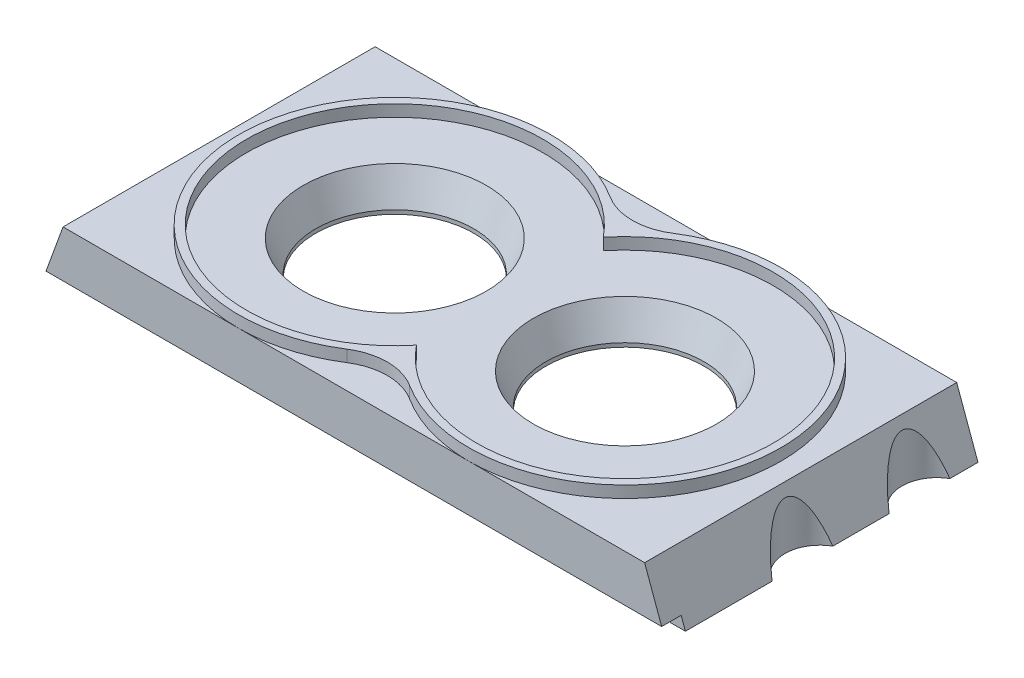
ISO-10303-21;
HEADER;
FILE_DESCRIPTION(('STEP AP214'),'2;1');
FILE_NAME('part.step','',(''),(''),'','','');
FILE_SCHEMA(('AUTOMOTIVE_DESIGN { 1 0 10303 214 1 1 1 1 }'));
ENDSEC;
DATA;
#1=APPLICATION_CONTEXT('core data for automotive mechanical design processes');
#2=APPLICATION_PROTOCOL_DEFINITION('international standard','automotive_design',2000,#1);
#3=PRODUCT_CONTEXT('',#1,'mechanical');
#4=PRODUCT('Part','Part','',(#3));
#5=PRODUCT_RELATED_PRODUCT_CATEGORY('part','',(#4));
#6=PRODUCT_DEFINITION_FORMATION('','',#4);
#7=PRODUCT_DEFINITION_CONTEXT('part definition',#1,'design');
#8=PRODUCT_DEFINITION('design','',#6,#7);
#9=PRODUCT_DEFINITION_SHAPE('','',#8);
#10=(LENGTH_UNIT() NAMED_UNIT(*) SI_UNIT(.MILLI.,.METRE.));
#11=(NAMED_UNIT(*) PLANE_ANGLE_UNIT() SI_UNIT($,.RADIAN.));
#12=(NAMED_UNIT(*) SI_UNIT($,.STERADIAN.) SOLID_ANGLE_UNIT());
#13=UNCERTAINTY_MEASURE_WITH_UNIT(LENGTH_MEASURE(1.E-05),#10,'distance_accuracy_value','');
#14=(GEOMETRIC_REPRESENTATION_CONTEXT(3) GLOBAL_UNCERTAINTY_ASSIGNED_CONTEXT((#13)) GLOBAL_UNIT_ASSIGNED_CONTEXT((#10,
#11,#12)) REPRESENTATION_CONTEXT('',''));
#15=CARTESIAN_POINT('',(0.,0.,0.));
#16=DIRECTION('',(0.,0.,1.));
#17=DIRECTION('',(1.,0.,0.));
#18=AXIS2_PLACEMENT_3D('',#15,#16,#17);
#19=CARTESIAN_POINT('',(-55.,12.4999999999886,0.));
#20=DIRECTION('',(0.,-1.,0.));
#21=DIRECTION('',(0.,0.,-1.));
#22=AXIS2_PLACEMENT_3D('',#19,#20,#21);
#23=CONICAL_SURFACE('',#22,1.25000000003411,1.02974425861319);
#24=CARTESIAN_POINT('',(-55.,12.5,0.));
#25=DIRECTION('',(0.,-1.,0.));
#26=DIRECTION('',(0.,0.,-1.));
#27=AXIS2_PLACEMENT_3D('',#24,#25,#26);
#28=CIRCLE('',#27,1.25);
#29=CARTESIAN_POINT('',(-55.,12.5,-1.25));
#30=VERTEX_POINT('',#29);
#31=EDGE_CURVE('E709',#30,#30,#28,.T.);
#32=ORIENTED_EDGE('',*,*,#31,.T.);
#33=EDGE_LOOP('',(#32));
#34=FACE_BOUND('',#33,.T.);
#35=CARTESIAN_POINT('',(-55.0000000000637,13.2510757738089,0.));
#36=VERTEX_POINT('',#35);
#37=VERTEX_LOOP('',#36);
#38=FACE_BOUND('',#37,.T.);
#39=ADVANCED_FACE('F16',(#34,#38),#23,.F.);
#40=CARTESIAN_POINT('',(-29.5,12.4999999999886,-25.5));
#41=DIRECTION('',(0.,-1.,0.));
#42=DIRECTION('',(0.,0.,-1.));
#43=AXIS2_PLACEMENT_3D('',#40,#41,#42);
#44=CONICAL_SURFACE('',#43,1.24999999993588,1.0297442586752);
#45=CARTESIAN_POINT('',(-29.5,12.5,-25.5));
#46=DIRECTION('',(0.,-1.,0.));
#47=DIRECTION('',(0.,0.,-1.));
#48=AXIS2_PLACEMENT_3D('',#45,#46,#47);
#49=CIRCLE('',#48,1.25);
#50=CARTESIAN_POINT('',(-29.5,12.5,-26.75));
#51=VERTEX_POINT('',#50);
#52=EDGE_CURVE('E730',#51,#51,#49,.T.);
#53=ORIENTED_EDGE('',*,*,#52,.T.);
#54=EDGE_LOOP('',(#53));
#55=FACE_BOUND('',#54,.T.);
#56=CARTESIAN_POINT('',(-29.5,13.2510757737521,-25.5000000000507));
#57=VERTEX_POINT('',#56);
#58=VERTEX_LOOP('',#57);
#59=FACE_BOUND('',#58,.T.);
#60=ADVANCED_FACE('F187',(#55,#59),#44,.F.);
#61=CARTESIAN_POINT('',(-4.,12.4999999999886,0.));
#62=DIRECTION('',(0.,-1.,0.));
#63=DIRECTION('',(0.,0.,-1.));
#64=AXIS2_PLACEMENT_3D('',#61,#62,#63);
#65=CONICAL_SURFACE('',#64,1.2499999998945,1.02974425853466);
#66=CARTESIAN_POINT('',(-4.,12.5,0.));
#67=DIRECTION('',(0.,-1.,0.));
#68=DIRECTION('',(0.,0.,-1.));
#69=AXIS2_PLACEMENT_3D('',#66,#67,#68);
#70=CIRCLE('',#69,1.25);
#71=CARTESIAN_POINT('',(-4.,12.5,-1.25));
#72=VERTEX_POINT('',#71);
#73=EDGE_CURVE('E727',#72,#72,#70,.T.);
#74=ORIENTED_EDGE('',*,*,#73,.T.);
#75=EDGE_LOOP('',(#74));
#76=FACE_BOUND('',#75,.T.);
#77=CARTESIAN_POINT('',(-3.99999999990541,13.2510757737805,0.));
#78=VERTEX_POINT('',#77);
#79=VERTEX_LOOP('',#78);
#80=FACE_BOUND('',#79,.T.);
#81=ADVANCED_FACE('F193',(#76,#80),#65,.F.);
#82=CARTESIAN_POINT('',(-29.5,12.4999999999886,25.5));
#83=DIRECTION('',(0.,-1.,0.));
#84=DIRECTION('',(0.,0.,-1.));
#85=AXIS2_PLACEMENT_3D('',#82,#83,#84);
#86=CONICAL_SURFACE('',#85,1.24999999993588,1.0297442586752);
#87=CARTESIAN_POINT('',(-29.5,12.5,25.5));
#88=DIRECTION('',(0.,-1.,0.));
#89=DIRECTION('',(0.,0.,-1.));
#90=AXIS2_PLACEMENT_3D('',#87,#88,#89);
#91=CIRCLE('',#90,1.25);
#92=CARTESIAN_POINT('',(-29.5,12.5,24.25));
#93=VERTEX_POINT('',#92);
#94=EDGE_CURVE('E724',#93,#93,#91,.T.);
#95=ORIENTED_EDGE('',*,*,#94,.T.);
#96=EDGE_LOOP('',(#95));
#97=FACE_BOUND('',#96,.T.);
#98=CARTESIAN_POINT('',(-29.5,13.2510757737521,25.5000000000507));
#99=VERTEX_POINT('',#98);
#100=VERTEX_LOOP('',#99);
#101=FACE_BOUND('',#100,.T.);
#102=ADVANCED_FACE('F1716',(#97,#101),#86,.F.);
#103=CARTESIAN_POINT('',(4.,12.4999999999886,0.));
#104=DIRECTION('',(0.,-1.,0.));
#105=DIRECTION('',(0.,0.,-1.));
#106=AXIS2_PLACEMENT_3D('',#103,#104,#105);
#107=CONICAL_SURFACE('',#106,1.2499999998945,1.02974425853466);
#108=CARTESIAN_POINT('',(4.,12.5,0.));
#109=DIRECTION('',(0.,-1.,0.));
#110=DIRECTION('',(0.,0.,-1.));
#111=AXIS2_PLACEMENT_3D('',#108,#109,#110);
#112=CIRCLE('',#111,1.25);
#113=CARTESIAN_POINT('',(4.,12.5,-1.25));
#114=VERTEX_POINT('',#113);
#115=EDGE_CURVE('E721',#114,#114,#112,.T.);
#116=ORIENTED_EDGE('',*,*,#115,.T.);
#117=EDGE_LOOP('',(#116));
#118=FACE_BOUND('',#117,.T.);
#119=CARTESIAN_POINT('',(3.99999999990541,13.2510757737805,0.));
#120=VERTEX_POINT('',#119);
#121=VERTEX_LOOP('',#120);
#122=FACE_BOUND('',#121,.T.);
#123=ADVANCED_FACE('F1707',(#118,#122),#107,.F.);
#124=CARTESIAN_POINT('',(29.5,12.4999999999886,25.5));
#125=DIRECTION('',(0.,-1.,0.));
#126=DIRECTION('',(0.,0.,-1.));
#127=AXIS2_PLACEMENT_3D('',#124,#125,#126);
#128=CONICAL_SURFACE('',#127,1.24999999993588,1.0297442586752);
#129=CARTESIAN_POINT('',(29.5,12.5,25.5));
#130=DIRECTION('',(0.,-1.,0.));
#131=DIRECTION('',(0.,0.,-1.));
#132=AXIS2_PLACEMENT_3D('',#129,#130,#131);
#133=CIRCLE('',#132,1.25);
#134=CARTESIAN_POINT('',(29.5,12.5,24.25));
#135=VERTEX_POINT('',#134);
#136=EDGE_CURVE('E718',#135,#135,#133,.T.);
#137=ORIENTED_EDGE('',*,*,#136,.T.);
#138=EDGE_LOOP('',(#137));
#139=FACE_BOUND('',#138,.T.);
#140=CARTESIAN_POINT('',(29.5,13.2510757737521,25.5000000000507));
#141=VERTEX_POINT('',#140);
#142=VERTEX_LOOP('',#141);
#143=FACE_BOUND('',#142,.T.);
#144=ADVANCED_FACE('F1698',(#139,#143),#128,.F.);
#145=CARTESIAN_POINT('',(55.,12.4999999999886,0.));
#146=DIRECTION('',(0.,-1.,0.));
#147=DIRECTION('',(0.,0.,-1.));
#148=AXIS2_PLACEMENT_3D('',#145,#146,#147);
#149=CONICAL_SURFACE('',#148,1.25000000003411,1.02974425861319);
#150=CARTESIAN_POINT('',(55.,12.5,0.));
#151=DIRECTION('',(0.,-1.,0.));
#152=DIRECTION('',(0.,0.,-1.));
#153=AXIS2_PLACEMENT_3D('',#150,#151,#152);
#154=CIRCLE('',#153,1.25);
#155=CARTESIAN_POINT('',(55.,12.5,-1.24999999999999));
#156=VERTEX_POINT('',#155);
#157=EDGE_CURVE('E715',#156,#156,#154,.T.);
#158=ORIENTED_EDGE('',*,*,#157,.T.);
#159=EDGE_LOOP('',(#158));
#160=FACE_BOUND('',#159,.T.);
#161=CARTESIAN_POINT('',(55.0000000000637,13.2510757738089,0.));
#162=VERTEX_POINT('',#161);
#163=VERTEX_LOOP('',#162);
#164=FACE_BOUND('',#163,.T.);
#165=ADVANCED_FACE('F1689',(#160,#164),#149,.F.);
#166=CARTESIAN_POINT('',(29.5,12.4999999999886,-25.5));
#167=DIRECTION('',(0.,-1.,0.));
#168=DIRECTION('',(0.,0.,-1.));
#169=AXIS2_PLACEMENT_3D('',#166,#167,#168);
#170=CONICAL_SURFACE('',#169,1.24999999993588,1.0297442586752);
#171=CARTESIAN_POINT('',(29.5,12.5,-25.5));
#172=DIRECTION('',(0.,-1.,0.));
#173=DIRECTION('',(0.,0.,-1.));
#174=AXIS2_PLACEMENT_3D('',#171,#172,#173);
#175=CIRCLE('',#174,1.25);
#176=CARTESIAN_POINT('',(29.5,12.5,-26.75));
#177=VERTEX_POINT('',#176);
#178=EDGE_CURVE('E711',#177,#177,#175,.T.);
#179=ORIENTED_EDGE('',*,*,#178,.T.);
#180=EDGE_LOOP('',(#179));
#181=FACE_BOUND('',#180,.T.);
#182=CARTESIAN_POINT('',(29.5,13.2510757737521,-25.5000000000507));
#183=VERTEX_POINT('',#182);
#184=VERTEX_LOOP('',#183);
#185=FACE_BOUND('',#184,.T.);
#186=ADVANCED_FACE('F1681',(#181,#185),#170,.F.);
#187=CARTESIAN_POINT('',(0.,0.,0.));
#188=DIRECTION('',(0.,1.,0.));
#189=DIRECTION('',(0.,0.,1.));
#190=AXIS2_PLACEMENT_3D('',#187,#188,#189);
#191=PLANE('',#190);
#192=CARTESIAN_POINT('',(-29.5,0.,0.));
#193=DIRECTION('',(0.,1.,0.));
#194=DIRECTION('',(0.,0.,1.));
#195=AXIS2_PLACEMENT_3D('',#192,#193,#194);
#196=CIRCLE('',#195,29.);
#197=CARTESIAN_POINT('',(-26.0999999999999,0.,28.8));
#198=VERTEX_POINT('',#197);
#199=CARTESIAN_POINT('',(-29.5,0.,-29.));
#200=VERTEX_POINT('',#199);
#201=EDGE_CURVE('E706',#198,#200,#196,.T.);
#202=ORIENTED_EDGE('',*,*,#201,.T.);
#203=DIRECTION('',(1.,0.,0.));
#204=VECTOR('',#203,1.);
#205=CARTESIAN_POINT('',(29.5,0.,-29.));
#206=LINE('',#205,#204);
#207=CARTESIAN_POINT('',(29.5,0.,-29.));
#208=VERTEX_POINT('',#207);
#209=EDGE_CURVE('E702',#200,#208,#206,.T.);
#210=ORIENTED_EDGE('',*,*,#209,.T.);
#211=CARTESIAN_POINT('',(29.5,0.,0.));
#212=DIRECTION('',(0.,1.,0.));
#213=DIRECTION('',(0.,0.,1.));
#214=AXIS2_PLACEMENT_3D('',#211,#212,#213);
#215=CIRCLE('',#214,29.);
#216=CARTESIAN_POINT('',(26.0999999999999,0.,28.8));
#217=VERTEX_POINT('',#216);
#218=EDGE_CURVE('E157',#208,#217,#215,.T.);
#219=ORIENTED_EDGE('',*,*,#218,.T.);
#220=DIRECTION('',(1.,0.,0.));
#221=VECTOR('',#220,1.);
#222=CARTESIAN_POINT('',(0.,0.,28.8));
#223=LINE('',#222,#221);
#224=EDGE_CURVE('E707',#198,#217,#223,.T.);
#225=ORIENTED_EDGE('',*,*,#224,.F.);
#226=EDGE_LOOP('',(#202,#210,#219,#225));
#227=FACE_BOUND('',#226,.T.);
#228=ADVANCED_FACE('F1672',(#227),#191,.F.);
#229=CARTESIAN_POINT('',(0.,0.1,28.9));
#230=DIRECTION('',(0.,-0.707106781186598,0.707106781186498));
#231=DIRECTION('',(0.,-0.707106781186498,-0.707106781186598));
#232=AXIS2_PLACEMENT_3D('',#229,#230,#231);
#233=PLANE('',#232);
#234=DIRECTION('',(-1.,0.,0.));
#235=VECTOR('',#234,1.);
#236=CARTESIAN_POINT('',(-29.5,0.200000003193,29.));
#237=LINE('',#236,#235);
#238=CARTESIAN_POINT('',(29.5,0.200000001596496,29.));
#239=VERTEX_POINT('',#238);
#240=CARTESIAN_POINT('',(-29.500000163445,0.200000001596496,29.));
#241=VERTEX_POINT('',#240);
#242=EDGE_CURVE('E703',#239,#241,#237,.T.);
#243=ORIENTED_EDGE('',*,*,#242,.T.);
#244=CARTESIAN_POINT('',(-29.5,-28.7999999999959,0.));
#245=DIRECTION('',(0.,-0.707106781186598,0.707106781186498));
#246=DIRECTION('',(0.,0.707106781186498,0.707106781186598));
#247=AXIS2_PLACEMENT_3D('',#244,#245,#246);
#248=ELLIPSE('',#247,41.0121933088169,29.);
#249=EDGE_CURVE('E699',#241,#198,#248,.F.);
#250=ORIENTED_EDGE('',*,*,#249,.T.);
#251=ORIENTED_EDGE('',*,*,#224,.T.);
#252=CARTESIAN_POINT('',(29.5,-28.7999999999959,0.));
#253=DIRECTION('',(0.,-0.707106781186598,0.707106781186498));
#254=DIRECTION('',(0.,0.707106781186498,0.707106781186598));
#255=AXIS2_PLACEMENT_3D('',#252,#253,#254);
#256=ELLIPSE('',#255,41.0121933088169,29.);
#257=EDGE_CURVE('E714',#217,#239,#256,.F.);
#258=ORIENTED_EDGE('',*,*,#257,.T.);
#259=EDGE_LOOP('',(#243,#250,#251,#258));
#260=FACE_BOUND('',#259,.T.);
#261=ADVANCED_FACE('F1662',(#260),#233,.T.);
#262=CARTESIAN_POINT('',(-55.,13.61362956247,0.));
#263=DIRECTION('',(0.,-1.,0.));
#264=DIRECTION('',(0.,0.,-1.));
#265=AXIS2_PLACEMENT_3D('',#262,#263,#264);
#266=CYLINDRICAL_SURFACE('',#265,1.25);
#267=ORIENTED_EDGE('',*,*,#31,.F.);
#268=EDGE_LOOP('',(#267));
#269=FACE_BOUND('',#268,.T.);
#270=CARTESIAN_POINT('',(-55.,6.,0.));
#271=DIRECTION('',(0.,-1.,0.));
#272=DIRECTION('',(0.,0.,-1.));
#273=AXIS2_PLACEMENT_3D('',#270,#271,#272);
#274=CIRCLE('',#273,1.25);
#275=CARTESIAN_POINT('',(-55.,6.,-1.25));
#276=VERTEX_POINT('',#275);
#277=EDGE_CURVE('E851',#276,#276,#274,.T.);
#278=ORIENTED_EDGE('',*,*,#277,.T.);
#279=EDGE_LOOP('',(#278));
#280=FACE_BOUND('',#279,.T.);
#281=ADVANCED_FACE('F1652',(#269,#280),#266,.F.);
#282=CARTESIAN_POINT('',(-29.5,13.61362956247,-25.5));
#283=DIRECTION('',(0.,-1.,0.));
#284=DIRECTION('',(0.,0.,-1.));
#285=AXIS2_PLACEMENT_3D('',#282,#283,#284);
#286=CYLINDRICAL_SURFACE('',#285,1.25);
#287=ORIENTED_EDGE('',*,*,#52,.F.);
#288=EDGE_LOOP('',(#287));
#289=FACE_BOUND('',#288,.T.);
#290=CARTESIAN_POINT('',(-29.5,6.,-25.5));
#291=DIRECTION('',(0.,-1.,0.));
#292=DIRECTION('',(0.,0.,-1.));
#293=AXIS2_PLACEMENT_3D('',#290,#291,#292);
#294=CIRCLE('',#293,1.25);
#295=CARTESIAN_POINT('',(-29.5,6.,-26.75));
#296=VERTEX_POINT('',#295);
#297=EDGE_CURVE('E848',#296,#296,#294,.T.);
#298=ORIENTED_EDGE('',*,*,#297,.T.);
#299=EDGE_LOOP('',(#298));
#300=FACE_BOUND('',#299,.T.);
#301=ADVANCED_FACE('F1642',(#289,#300),#286,.F.);
#302=CARTESIAN_POINT('',(-4.,13.61362956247,0.));
#303=DIRECTION('',(0.,-1.,0.));
#304=DIRECTION('',(0.,0.,-1.));
#305=AXIS2_PLACEMENT_3D('',#302,#303,#304);
#306=CYLINDRICAL_SURFACE('',#305,1.25);
#307=ORIENTED_EDGE('',*,*,#73,.F.);
#308=EDGE_LOOP('',(#307));
#309=FACE_BOUND('',#308,.T.);
#310=CARTESIAN_POINT('',(-4.,6.,0.));
#311=DIRECTION('',(0.,-1.,0.));
#312=DIRECTION('',(0.,0.,-1.));
#313=AXIS2_PLACEMENT_3D('',#310,#311,#312);
#314=CIRCLE('',#313,1.25);
#315=CARTESIAN_POINT('',(-4.,6.,-1.25));
#316=VERTEX_POINT('',#315);
#317=EDGE_CURVE('E845',#316,#316,#314,.T.);
#318=ORIENTED_EDGE('',*,*,#317,.T.);
#319=EDGE_LOOP('',(#318));
#320=FACE_BOUND('',#319,.T.);
#321=ADVANCED_FACE('F1632',(#309,#320),#306,.F.);
#322=CARTESIAN_POINT('',(-29.5,13.61362956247,25.5));
#323=DIRECTION('',(0.,-1.,0.));
#324=DIRECTION('',(0.,0.,-1.));
#325=AXIS2_PLACEMENT_3D('',#322,#323,#324);
#326=CYLINDRICAL_SURFACE('',#325,1.25);
#327=ORIENTED_EDGE('',*,*,#94,.F.);
#328=EDGE_LOOP('',(#327));
#329=FACE_BOUND('',#328,.T.);
#330=CARTESIAN_POINT('',(-29.5,6.,25.5));
#331=DIRECTION('',(0.,-1.,0.));
#332=DIRECTION('',(0.,0.,-1.));
#333=AXIS2_PLACEMENT_3D('',#330,#331,#332);
#334=CIRCLE('',#333,1.25);
#335=CARTESIAN_POINT('',(-29.5,6.,24.25));
#336=VERTEX_POINT('',#335);
#337=EDGE_CURVE('E842',#336,#336,#334,.T.);
#338=ORIENTED_EDGE('',*,*,#337,.T.);
#339=EDGE_LOOP('',(#338));
#340=FACE_BOUND('',#339,.T.);
#341=ADVANCED_FACE('F1622',(#329,#340),#326,.F.);
#342=CARTESIAN_POINT('',(4.,13.61362956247,0.));
#343=DIRECTION('',(0.,-1.,0.));
#344=DIRECTION('',(0.,0.,-1.));
#345=AXIS2_PLACEMENT_3D('',#342,#343,#344);
#346=CYLINDRICAL_SURFACE('',#345,1.25);
#347=ORIENTED_EDGE('',*,*,#115,.F.);
#348=EDGE_LOOP('',(#347));
#349=FACE_BOUND('',#348,.T.);
#350=CARTESIAN_POINT('',(4.,6.,0.));
#351=DIRECTION('',(0.,-1.,0.));
#352=DIRECTION('',(0.,0.,-1.));
#353=AXIS2_PLACEMENT_3D('',#350,#351,#352);
#354=CIRCLE('',#353,1.25);
#355=CARTESIAN_POINT('',(4.,6.,-1.25));
#356=VERTEX_POINT('',#355);
#357=EDGE_CURVE('E836',#356,#356,#354,.T.);
#358=ORIENTED_EDGE('',*,*,#357,.T.);
#359=EDGE_LOOP('',(#358));
#360=FACE_BOUND('',#359,.T.);
#361=ADVANCED_FACE('F1612',(#349,#360),#346,.F.);
#362=CARTESIAN_POINT('',(29.5,13.61362956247,25.5));
#363=DIRECTION('',(0.,-1.,0.));
#364=DIRECTION('',(0.,0.,-1.));
#365=AXIS2_PLACEMENT_3D('',#362,#363,#364);
#366=CYLINDRICAL_SURFACE('',#365,1.25);
#367=ORIENTED_EDGE('',*,*,#136,.F.);
#368=EDGE_LOOP('',(#367));
#369=FACE_BOUND('',#368,.T.);
#370=CARTESIAN_POINT('',(29.5,6.,25.5));
#371=DIRECTION('',(0.,-1.,0.));
#372=DIRECTION('',(0.,0.,-1.));
#373=AXIS2_PLACEMENT_3D('',#370,#371,#372);
#374=CIRCLE('',#373,1.25);
#375=CARTESIAN_POINT('',(29.5,6.,24.25));
#376=VERTEX_POINT('',#375);
#377=EDGE_CURVE('E833',#376,#376,#374,.T.);
#378=ORIENTED_EDGE('',*,*,#377,.T.);
#379=EDGE_LOOP('',(#378));
#380=FACE_BOUND('',#379,.T.);
#381=ADVANCED_FACE('F1602',(#369,#380),#366,.F.);
#382=CARTESIAN_POINT('',(55.,13.61362956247,0.));
#383=DIRECTION('',(0.,-1.,0.));
#384=DIRECTION('',(0.,0.,-1.));
#385=AXIS2_PLACEMENT_3D('',#382,#383,#384);
#386=CYLINDRICAL_SURFACE('',#385,1.25);
#387=ORIENTED_EDGE('',*,*,#157,.F.);
#388=EDGE_LOOP('',(#387));
#389=FACE_BOUND('',#388,.T.);
#390=CARTESIAN_POINT('',(55.,6.,0.));
#391=DIRECTION('',(0.,-1.,0.));
#392=DIRECTION('',(0.,0.,-1.));
#393=AXIS2_PLACEMENT_3D('',#390,#391,#392);
#394=CIRCLE('',#393,1.25);
#395=CARTESIAN_POINT('',(55.,6.,-1.24999999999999));
#396=VERTEX_POINT('',#395);
#397=EDGE_CURVE('E830',#396,#396,#394,.T.);
#398=ORIENTED_EDGE('',*,*,#397,.T.);
#399=EDGE_LOOP('',(#398));
#400=FACE_BOUND('',#399,.T.);
#401=ADVANCED_FACE('F1592',(#389,#400),#386,.F.);
#402=CARTESIAN_POINT('',(29.5,13.61362956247,-25.5));
#403=DIRECTION('',(0.,-1.,0.));
#404=DIRECTION('',(0.,0.,-1.));
#405=AXIS2_PLACEMENT_3D('',#402,#403,#404);
#406=CYLINDRICAL_SURFACE('',#405,1.25);
#407=ORIENTED_EDGE('',*,*,#178,.F.);
#408=EDGE_LOOP('',(#407));
#409=FACE_BOUND('',#408,.T.);
#410=CARTESIAN_POINT('',(29.5,6.,-25.5));
#411=DIRECTION('',(0.,-1.,0.));
#412=DIRECTION('',(0.,0.,-1.));
#413=AXIS2_PLACEMENT_3D('',#410,#411,#412);
#414=CIRCLE('',#413,1.25);
#415=CARTESIAN_POINT('',(29.5,6.,-26.75));
#416=VERTEX_POINT('',#415);
#417=EDGE_CURVE('E827',#416,#416,#414,.T.);
#418=ORIENTED_EDGE('',*,*,#417,.T.);
#419=EDGE_LOOP('',(#418));
#420=FACE_BOUND('',#419,.T.);
#421=ADVANCED_FACE('F1583',(#409,#420),#406,.F.);
#422=CARTESIAN_POINT('',(29.5,0.,0.));
#423=DIRECTION('',(0.,1.,0.));
#424=DIRECTION('',(0.,0.,1.));
#425=AXIS2_PLACEMENT_3D('',#422,#423,#424);
#426=CYLINDRICAL_SURFACE('',#425,29.);
#427=CARTESIAN_POINT('',(29.5,6.,0.));
#428=DIRECTION('',(0.,1.,0.));
#429=DIRECTION('',(0.,0.,1.));
#430=AXIS2_PLACEMENT_3D('',#427,#428,#429);
#431=CIRCLE('',#430,29.);
#432=CARTESIAN_POINT('',(29.5,6.,29.));
#433=VERTEX_POINT('',#432);
#434=EDGE_CURVE('E839',#433,#433,#431,.T.);
#435=ORIENTED_EDGE('',*,*,#434,.T.);
#436=EDGE_LOOP('',(#435));
#437=FACE_BOUND('',#436,.T.);
#438=ORIENTED_EDGE('',*,*,#257,.F.);
#439=ORIENTED_EDGE('',*,*,#218,.F.);
#440=DIRECTION('',(0.,1.,0.));
#441=VECTOR('',#440,1.);
#442=CARTESIAN_POINT('',(29.5,0.,-29.));
#443=LINE('',#442,#441);
#444=CARTESIAN_POINT('',(29.5,2.3,-29.));
#445=VERTEX_POINT('',#444);
#446=EDGE_CURVE('E700',#208,#445,#443,.T.);
#447=ORIENTED_EDGE('',*,*,#446,.T.);
#448=CARTESIAN_POINT('',(29.5,2.3,0.));
#449=DIRECTION('',(0.,1.,0.));
#450=DIRECTION('',(0.,0.,1.));
#451=AXIS2_PLACEMENT_3D('',#448,#449,#450);
#452=CIRCLE('',#451,29.);
#453=CARTESIAN_POINT('',(29.5,2.3,29.));
#454=VERTEX_POINT('',#453);
#455=EDGE_CURVE('E824',#454,#445,#452,.T.);
#456=ORIENTED_EDGE('',*,*,#455,.F.);
#457=DIRECTION('',(0.,1.,0.));
#458=VECTOR('',#457,1.);
#459=CARTESIAN_POINT('',(29.5,0.,29.));
#460=LINE('',#459,#458);
#461=EDGE_CURVE('E857',#454,#239,#460,.F.);
#462=ORIENTED_EDGE('',*,*,#461,.T.);
#463=EDGE_LOOP('',(#438,#439,#447,#456,#462));
#464=FACE_BOUND('',#463,.T.);
#465=ADVANCED_FACE('F1574',(#437,#464),#426,.F.);
#466=CARTESIAN_POINT('',(29.5,0.,-29.));
#467=DIRECTION('',(0.,0.,1.));
#468=DIRECTION('',(1.,0.,0.));
#469=AXIS2_PLACEMENT_3D('',#466,#467,#468);
#470=PLANE('',#469);
#471=DIRECTION('',(1.,0.,0.));
#472=VECTOR('',#471,1.);
#473=CARTESIAN_POINT('',(0.,2.3,-29.));
#474=LINE('',#473,#472);
#475=CARTESIAN_POINT('',(-29.5,2.3,-29.));
#476=VERTEX_POINT('',#475);
#477=EDGE_CURVE('E644',#445,#476,#474,.F.);
#478=ORIENTED_EDGE('',*,*,#477,.F.);
#479=ORIENTED_EDGE('',*,*,#446,.F.);
#480=ORIENTED_EDGE('',*,*,#209,.F.);
#481=DIRECTION('',(0.,1.,0.));
#482=VECTOR('',#481,1.);
#483=CARTESIAN_POINT('',(-29.5,0.,-29.));
#484=LINE('',#483,#482);
#485=EDGE_CURVE('E691',#200,#476,#484,.T.);
#486=ORIENTED_EDGE('',*,*,#485,.T.);
#487=EDGE_LOOP('',(#478,#479,#480,#486));
#488=FACE_BOUND('',#487,.T.);
#489=ADVANCED_FACE('F1565',(#488),#470,.F.);
#490=CARTESIAN_POINT('',(-29.5,0.,0.));
#491=DIRECTION('',(0.,1.,0.));
#492=DIRECTION('',(0.,0.,1.));
#493=AXIS2_PLACEMENT_3D('',#490,#491,#492);
#494=CYLINDRICAL_SURFACE('',#493,29.);
#495=CARTESIAN_POINT('',(-29.5,6.,0.));
#496=DIRECTION('',(0.,1.,0.));
#497=DIRECTION('',(0.,0.,1.));
#498=AXIS2_PLACEMENT_3D('',#495,#496,#497);
#499=CIRCLE('',#498,29.);
#500=CARTESIAN_POINT('',(-29.5,6.,29.));
#501=VERTEX_POINT('',#500);
#502=EDGE_CURVE('E854',#501,#501,#499,.T.);
#503=ORIENTED_EDGE('',*,*,#502,.T.);
#504=EDGE_LOOP('',(#503));
#505=FACE_BOUND('',#504,.T.);
#506=CARTESIAN_POINT('',(-29.5,2.3,0.));
#507=DIRECTION('',(0.,1.,0.));
#508=DIRECTION('',(0.,0.,1.));
#509=AXIS2_PLACEMENT_3D('',#506,#507,#508);
#510=CIRCLE('',#509,29.);
#511=CARTESIAN_POINT('',(-29.500000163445,2.3,29.));
#512=VERTEX_POINT('',#511);
#513=EDGE_CURVE('E821',#476,#512,#510,.T.);
#514=ORIENTED_EDGE('',*,*,#513,.F.);
#515=ORIENTED_EDGE('',*,*,#485,.F.);
#516=ORIENTED_EDGE('',*,*,#201,.F.);
#517=ORIENTED_EDGE('',*,*,#249,.F.);
#518=DIRECTION('',(0.,1.,0.));
#519=VECTOR('',#518,1.);
#520=CARTESIAN_POINT('',(-29.50000032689,0.,29.));
#521=LINE('',#520,#519);
#522=EDGE_CURVE('E705',#241,#512,#521,.T.);
#523=ORIENTED_EDGE('',*,*,#522,.T.);
#524=EDGE_LOOP('',(#514,#515,#516,#517,#523));
#525=FACE_BOUND('',#524,.T.);
#526=ADVANCED_FACE('F1556',(#505,#525),#494,.F.);
#527=CARTESIAN_POINT('',(-29.5,0.,29.));
#528=DIRECTION('',(0.,0.,-1.));
#529=DIRECTION('',(-1.,0.,0.));
#530=AXIS2_PLACEMENT_3D('',#527,#528,#529);
#531=PLANE('',#530);
#532=DIRECTION('',(1.,0.,0.));
#533=VECTOR('',#532,1.);
#534=CARTESIAN_POINT('',(0.,2.3,29.));
#535=LINE('',#534,#533);
#536=EDGE_CURVE('E820',#512,#454,#535,.T.);
#537=ORIENTED_EDGE('',*,*,#536,.F.);
#538=ORIENTED_EDGE('',*,*,#522,.F.);
#539=ORIENTED_EDGE('',*,*,#242,.F.);
#540=ORIENTED_EDGE('',*,*,#461,.F.);
#541=EDGE_LOOP('',(#537,#538,#539,#540));
#542=FACE_BOUND('',#541,.T.);
#543=ADVANCED_FACE('F1547',(#542),#531,.F.);
#544=CARTESIAN_POINT('',(-29.5,6.,0.));
#545=DIRECTION('',(0.,1.,0.));
#546=DIRECTION('',(0.,0.,1.));
#547=AXIS2_PLACEMENT_3D('',#544,#545,#546);
#548=PLANE('',#547);
#549=CARTESIAN_POINT('',(-29.5,5.99999999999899,-6.41847686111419E-13));
#550=DIRECTION('',(0.,-1.,0.));
#551=DIRECTION('',(1.,0.,0.));
#552=AXIS2_PLACEMENT_3D('',#549,#550,#551);
#553=CIRCLE('',#552,22.949999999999);
#554=CARTESIAN_POINT('',(-6.55000000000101,5.99999999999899,-6.41847686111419E-13));
#555=VERTEX_POINT('',#554);
#556=EDGE_CURVE('E817',#555,#555,#553,.F.);
#557=ORIENTED_EDGE('',*,*,#556,.T.);
#558=EDGE_LOOP('',(#557));
#559=FACE_BOUND('',#558,.T.);
#560=ORIENTED_EDGE('',*,*,#337,.F.);
#561=EDGE_LOOP('',(#560));
#562=FACE_BOUND('',#561,.T.);
#563=ORIENTED_EDGE('',*,*,#317,.F.);
#564=EDGE_LOOP('',(#563));
#565=FACE_BOUND('',#564,.T.);
#566=ORIENTED_EDGE('',*,*,#297,.F.);
#567=EDGE_LOOP('',(#566));
#568=FACE_BOUND('',#567,.T.);
#569=ORIENTED_EDGE('',*,*,#277,.F.);
#570=EDGE_LOOP('',(#569));
#571=FACE_BOUND('',#570,.T.);
#572=ORIENTED_EDGE('',*,*,#502,.F.);
#573=EDGE_LOOP('',(#572));
#574=FACE_BOUND('',#573,.T.);
#575=ADVANCED_FACE('F1538',(#559,#562,#565,#568,#571,#574),#548,.F.);
#576=CARTESIAN_POINT('',(29.5,6.,0.));
#577=DIRECTION('',(0.,1.,0.));
#578=DIRECTION('',(0.,0.,1.));
#579=AXIS2_PLACEMENT_3D('',#576,#577,#578);
#580=PLANE('',#579);
#581=CARTESIAN_POINT('',(29.5,5.99999999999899,-6.41847686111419E-13));
#582=DIRECTION('',(0.,-1.,0.));
#583=DIRECTION('',(1.,0.,0.));
#584=AXIS2_PLACEMENT_3D('',#581,#582,#583);
#585=CIRCLE('',#584,22.949999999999);
#586=CARTESIAN_POINT('',(52.449999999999,5.99999999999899,-6.41847686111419E-13));
#587=VERTEX_POINT('',#586);
#588=EDGE_CURVE('E625',#587,#587,#585,.F.);
#589=ORIENTED_EDGE('',*,*,#588,.T.);
#590=EDGE_LOOP('',(#589));
#591=FACE_BOUND('',#590,.T.);
#592=ORIENTED_EDGE('',*,*,#417,.F.);
#593=EDGE_LOOP('',(#592));
#594=FACE_BOUND('',#593,.T.);
#595=ORIENTED_EDGE('',*,*,#397,.F.);
#596=EDGE_LOOP('',(#595));
#597=FACE_BOUND('',#596,.T.);
#598=ORIENTED_EDGE('',*,*,#377,.F.);
#599=EDGE_LOOP('',(#598));
#600=FACE_BOUND('',#599,.T.);
#601=ORIENTED_EDGE('',*,*,#357,.F.);
#602=EDGE_LOOP('',(#601));
#603=FACE_BOUND('',#602,.T.);
#604=ORIENTED_EDGE('',*,*,#434,.F.);
#605=EDGE_LOOP('',(#604));
#606=FACE_BOUND('',#605,.T.);
#607=ADVANCED_FACE('F1529',(#591,#594,#597,#600,#603,#606),#580,.F.);
#608=CARTESIAN_POINT('',(0.,2.3,0.));
#609=DIRECTION('',(0.,-1.,0.));
#610=DIRECTION('',(0.,0.,-1.));
#611=AXIS2_PLACEMENT_3D('',#608,#609,#610);
#612=PLANE('',#611);
#613=ORIENTED_EDGE('',*,*,#513,.T.);
#614=ORIENTED_EDGE('',*,*,#536,.T.);
#615=ORIENTED_EDGE('',*,*,#455,.T.);
#616=ORIENTED_EDGE('',*,*,#477,.T.);
#617=EDGE_LOOP('',(#613,#614,#615,#616));
#618=FACE_BOUND('',#617,.T.);
#619=CARTESIAN_POINT('',(-29.5,2.3,0.));
#620=DIRECTION('',(0.,1.,0.));
#621=DIRECTION('',(0.,0.,-1.));
#622=AXIS2_PLACEMENT_3D('',#619,#620,#621);
#623=CIRCLE('',#622,32.4);
#624=CARTESIAN_POINT('',(-29.5,2.3,32.4));
#625=VERTEX_POINT('',#624);
#626=CARTESIAN_POINT('',(-29.499999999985,2.3,-32.4));
#627=VERTEX_POINT('',#626);
#628=EDGE_CURVE('E613',#625,#627,#623,.F.);
#629=ORIENTED_EDGE('',*,*,#628,.T.);
#630=DIRECTION('',(-1.,0.,0.));
#631=VECTOR('',#630,1.);
#632=CARTESIAN_POINT('',(29.89425757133,2.3,-32.4));
#633=LINE('',#632,#631);
#634=CARTESIAN_POINT('',(29.4999999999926,2.3,-32.4));
#635=VERTEX_POINT('',#634);
#636=EDGE_CURVE('E618',#627,#635,#633,.F.);
#637=ORIENTED_EDGE('',*,*,#636,.T.);
#638=CARTESIAN_POINT('',(29.5,2.3,0.));
#639=DIRECTION('',(0.,1.,0.));
#640=DIRECTION('',(-9.26042507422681E-13,0.,1.));
#641=AXIS2_PLACEMENT_3D('',#638,#639,#640);
#642=CIRCLE('',#641,32.4);
#643=CARTESIAN_POINT('',(29.4999999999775,2.3,32.4));
#644=VERTEX_POINT('',#643);
#645=EDGE_CURVE('E635',#635,#644,#642,.F.);
#646=ORIENTED_EDGE('',*,*,#645,.T.);
#647=DIRECTION('',(1.,0.,0.));
#648=VECTOR('',#647,1.);
#649=CARTESIAN_POINT('',(-29.89425757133,2.3,32.4));
#650=LINE('',#649,#648);
#651=EDGE_CURVE('E621',#644,#625,#650,.F.);
#652=ORIENTED_EDGE('',*,*,#651,.T.);
#653=EDGE_LOOP('',(#629,#637,#646,#652));
#654=FACE_BOUND('',#653,.T.);
#655=ADVANCED_FACE('F616',(#618,#654),#612,.T.);
#656=CARTESIAN_POINT('',(-29.5,5.99999999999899,-6.41847686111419E-13));
#657=DIRECTION('',(0.,-1.,0.));
#658=DIRECTION('',(1.,0.,0.));
#659=AXIS2_PLACEMENT_3D('',#656,#657,#658);
#660=CONICAL_SURFACE('',#659,22.949999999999,0.785398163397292);
#661=CARTESIAN_POINT('',(-29.5,6.1,0.));
#662=DIRECTION('',(0.,-1.,0.));
#663=DIRECTION('',(0.,0.,-1.));
#664=AXIS2_PLACEMENT_3D('',#661,#662,#663);
#665=CIRCLE('',#664,22.85);
#666=CARTESIAN_POINT('',(-29.5,6.1,-22.85));
#667=VERTEX_POINT('',#666);
#668=EDGE_CURVE('E1156',#667,#667,#665,.F.);
#669=ORIENTED_EDGE('',*,*,#668,.T.);
#670=EDGE_LOOP('',(#669));
#671=FACE_BOUND('',#670,.T.);
#672=ORIENTED_EDGE('',*,*,#556,.F.);
#673=EDGE_LOOP('',(#672));
#674=FACE_BOUND('',#673,.T.);
#675=ADVANCED_FACE('F1514',(#671,#674),#660,.F.);
#676=CARTESIAN_POINT('',(29.5,5.99999999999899,-6.41847686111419E-13));
#677=DIRECTION('',(0.,-1.,0.));
#678=DIRECTION('',(1.,0.,0.));
#679=AXIS2_PLACEMENT_3D('',#676,#677,#678);
#680=CONICAL_SURFACE('',#679,22.949999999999,0.785398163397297);
#681=CARTESIAN_POINT('',(29.5,6.1,0.));
#682=DIRECTION('',(0.,-1.,0.));
#683=DIRECTION('',(0.,0.,-1.));
#684=AXIS2_PLACEMENT_3D('',#681,#682,#683);
#685=CIRCLE('',#684,22.85);
#686=CARTESIAN_POINT('',(29.5,6.1,-22.85));
#687=VERTEX_POINT('',#686);
#688=EDGE_CURVE('E681',#687,#687,#685,.F.);
#689=ORIENTED_EDGE('',*,*,#688,.T.);
#690=EDGE_LOOP('',(#689));
#691=FACE_BOUND('',#690,.T.);
#692=ORIENTED_EDGE('',*,*,#588,.F.);
#693=EDGE_LOOP('',(#692));
#694=FACE_BOUND('',#693,.T.);
#695=ADVANCED_FACE('F686',(#691,#694),#680,.F.);
#696=CARTESIAN_POINT('',(-29.5,1.7,0.));
#697=DIRECTION('',(0.,-1.,0.));
#698=DIRECTION('',(0.0119469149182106,0.,-0.999928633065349));
#699=AXIS2_PLACEMENT_3D('',#696,#697,#698);
#700=TOROIDAL_SURFACE('',#699,32.4,0.6);
#701=CARTESIAN_POINT('',(-29.5,1.7,0.));
#702=DIRECTION('',(0.,-1.,0.));
#703=DIRECTION('',(0.,0.,-1.));
#704=AXIS2_PLACEMENT_3D('',#701,#702,#703);
#705=CIRCLE('',#704,33.);
#706=CARTESIAN_POINT('',(-29.5,1.7,33.));
#707=VERTEX_POINT('',#706);
#708=CARTESIAN_POINT('',(-29.4999999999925,1.7,-33.));
#709=VERTEX_POINT('',#708);
#710=EDGE_CURVE('E632',#707,#709,#705,.T.);
#711=ORIENTED_EDGE('',*,*,#710,.T.);
#712=CARTESIAN_POINT('',(-29.49999999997,1.7,-32.4));
#713=DIRECTION('',(-1.,0.,0.));
#714=DIRECTION('',(0.,0.,1.));
#715=AXIS2_PLACEMENT_3D('',#712,#713,#714);
#716=CIRCLE('',#715,0.6);
#717=EDGE_CURVE('E629',#709,#627,#716,.F.);
#718=ORIENTED_EDGE('',*,*,#717,.T.);
#719=ORIENTED_EDGE('',*,*,#628,.F.);
#720=CARTESIAN_POINT('',(-29.5,1.7,32.4));
#721=DIRECTION('',(1.,0.,0.));
#722=DIRECTION('',(0.,0.,-1.));
#723=AXIS2_PLACEMENT_3D('',#720,#721,#722);
#724=CIRCLE('',#723,0.6);
#725=EDGE_CURVE('E1157',#625,#707,#724,.T.);
#726=ORIENTED_EDGE('',*,*,#725,.T.);
#727=EDGE_LOOP('',(#711,#718,#719,#726));
#728=FACE_BOUND('',#727,.T.);
#729=ADVANCED_FACE('F630',(#728),#700,.F.);
#730=CARTESIAN_POINT('',(29.89425757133,1.7,-32.4));
#731=DIRECTION('',(-1.,0.,0.));
#732=DIRECTION('',(0.,0.,1.));
#733=AXIS2_PLACEMENT_3D('',#730,#731,#732);
#734=CYLINDRICAL_SURFACE('',#733,0.6);
#735=DIRECTION('',(-1.,0.,0.));
#736=VECTOR('',#735,1.);
#737=CARTESIAN_POINT('',(-29.5,1.7,-33.));
#738=LINE('',#737,#736);
#739=CARTESIAN_POINT('',(29.4999999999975,1.7,-33.));
#740=VERTEX_POINT('',#739);
#741=EDGE_CURVE('E1137',#709,#740,#738,.F.);
#742=ORIENTED_EDGE('',*,*,#741,.T.);
#743=CARTESIAN_POINT('',(29.4999999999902,1.7,-32.4));
#744=DIRECTION('',(1.,0.,-3.0305098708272E-13));
#745=DIRECTION('',(-3.03087416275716E-13,0.,-1.));
#746=AXIS2_PLACEMENT_3D('',#743,#744,#745);
#747=CIRCLE('',#746,0.6);
#748=EDGE_CURVE('E639',#740,#635,#747,.T.);
#749=ORIENTED_EDGE('',*,*,#748,.T.);
#750=ORIENTED_EDGE('',*,*,#636,.F.);
#751=ORIENTED_EDGE('',*,*,#717,.F.);
#752=EDGE_LOOP('',(#742,#749,#750,#751));
#753=FACE_BOUND('',#752,.T.);
#754=ADVANCED_FACE('F637',(#753),#734,.F.);
#755=CARTESIAN_POINT('',(29.5,1.7,0.));
#756=DIRECTION('',(0.,-1.,0.));
#757=DIRECTION('',(-0.0119469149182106,0.,0.999928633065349));
#758=AXIS2_PLACEMENT_3D('',#755,#756,#757);
#759=TOROIDAL_SURFACE('',#758,32.4,0.6);
#760=CARTESIAN_POINT('',(29.5,1.7,0.));
#761=DIRECTION('',(0.,-1.,0.));
#762=DIRECTION('',(0.,0.,-1.));
#763=AXIS2_PLACEMENT_3D('',#760,#761,#762);
#764=CIRCLE('',#763,33.);
#765=CARTESIAN_POINT('',(29.4999999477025,1.7,33.));
#766=VERTEX_POINT('',#765);
#767=EDGE_CURVE('E1128',#740,#766,#764,.T.);
#768=ORIENTED_EDGE('',*,*,#767,.T.);
#769=CARTESIAN_POINT('',(29.49999999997,1.7,32.4));
#770=DIRECTION('',(1.,0.,0.));
#771=DIRECTION('',(0.,0.,-1.));
#772=AXIS2_PLACEMENT_3D('',#769,#770,#771);
#773=CIRCLE('',#772,0.6);
#774=EDGE_CURVE('E1154',#766,#644,#773,.F.);
#775=ORIENTED_EDGE('',*,*,#774,.T.);
#776=ORIENTED_EDGE('',*,*,#645,.F.);
#777=ORIENTED_EDGE('',*,*,#748,.F.);
#778=EDGE_LOOP('',(#768,#775,#776,#777));
#779=FACE_BOUND('',#778,.T.);
#780=ADVANCED_FACE('F655',(#779),#759,.F.);
#781=CARTESIAN_POINT('',(-29.89425757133,1.7,32.4));
#782=DIRECTION('',(1.,0.,0.));
#783=DIRECTION('',(0.,0.,-1.));
#784=AXIS2_PLACEMENT_3D('',#781,#782,#783);
#785=CYLINDRICAL_SURFACE('',#784,0.6);
#786=DIRECTION('',(1.,0.,0.));
#787=VECTOR('',#786,1.);
#788=CARTESIAN_POINT('',(29.5,1.7,33.));
#789=LINE('',#788,#787);
#790=EDGE_CURVE('E1117',#766,#707,#789,.F.);
#791=ORIENTED_EDGE('',*,*,#790,.T.);
#792=ORIENTED_EDGE('',*,*,#725,.F.);
#793=ORIENTED_EDGE('',*,*,#651,.F.);
#794=ORIENTED_EDGE('',*,*,#774,.F.);
#795=EDGE_LOOP('',(#791,#792,#793,#794));
#796=FACE_BOUND('',#795,.T.);
#797=ADVANCED_FACE('F666',(#796),#785,.F.);
#798=CARTESIAN_POINT('',(-29.5,6.,0.));
#799=DIRECTION('',(0.,-1.,0.));
#800=DIRECTION('',(0.,0.,-1.));
#801=AXIS2_PLACEMENT_3D('',#798,#799,#800);
#802=CYLINDRICAL_SURFACE('',#801,22.85);
#803=ORIENTED_EDGE('',*,*,#668,.F.);
#804=EDGE_LOOP('',(#803));
#805=FACE_BOUND('',#804,.T.);
#806=CARTESIAN_POINT('',(-29.5,6.85,0.));
#807=DIRECTION('',(0.,-1.,0.));
#808=DIRECTION('',(0.999851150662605,0.,0.0172533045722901));
#809=AXIS2_PLACEMENT_3D('',#806,#807,#808);
#810=CIRCLE('',#809,22.85);
#811=CARTESIAN_POINT('',(-6.65340120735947,6.85,0.394238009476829));
#812=VERTEX_POINT('',#811);
#813=EDGE_CURVE('E1112',#812,#812,#810,.F.);
#814=ORIENTED_EDGE('',*,*,#813,.T.);
#815=EDGE_LOOP('',(#814));
#816=FACE_BOUND('',#815,.T.);
#817=ADVANCED_FACE('F1476',(#805,#816),#802,.F.);
#818=CARTESIAN_POINT('',(29.5,6.,0.));
#819=DIRECTION('',(0.,-1.,0.));
#820=DIRECTION('',(0.,0.,-1.));
#821=AXIS2_PLACEMENT_3D('',#818,#819,#820);
#822=CYLINDRICAL_SURFACE('',#821,22.85);
#823=ORIENTED_EDGE('',*,*,#688,.F.);
#824=EDGE_LOOP('',(#823));
#825=FACE_BOUND('',#824,.T.);
#826=CARTESIAN_POINT('',(29.5,6.85,0.));
#827=DIRECTION('',(0.,-1.,0.));
#828=DIRECTION('',(0.999851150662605,0.,0.0172533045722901));
#829=AXIS2_PLACEMENT_3D('',#826,#827,#828);
#830=CIRCLE('',#829,22.85);
#831=CARTESIAN_POINT('',(52.3465987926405,6.85,0.394238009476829));
#832=VERTEX_POINT('',#831);
#833=EDGE_CURVE('E1122',#832,#832,#830,.F.);
#834=ORIENTED_EDGE('',*,*,#833,.T.);
#835=EDGE_LOOP('',(#834));
#836=FACE_BOUND('',#835,.T.);
#837=ADVANCED_FACE('F1468',(#825,#836),#822,.F.);
#838=CARTESIAN_POINT('',(-29.5,0.,0.));
#839=DIRECTION('',(0.,-1.,0.));
#840=DIRECTION('',(0.,0.,-1.));
#841=AXIS2_PLACEMENT_3D('',#838,#839,#840);
#842=CYLINDRICAL_SURFACE('',#841,33.);
#843=CARTESIAN_POINT('',(-29.5,0.200000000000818,6.004086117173E-13));
#844=DIRECTION('',(0.,-1.,0.));
#845=DIRECTION('',(0.,0.,-1.));
#846=AXIS2_PLACEMENT_3D('',#843,#844,#845);
#847=CIRCLE('',#846,33.);
#848=CARTESIAN_POINT('',(-29.5,0.200000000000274,33.0000000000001));
#849=VERTEX_POINT('',#848);
#850=CARTESIAN_POINT('',(-29.5,0.200000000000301,-32.9999999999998));
#851=VERTEX_POINT('',#850);
#852=EDGE_CURVE('E1120',#849,#851,#847,.T.);
#853=ORIENTED_EDGE('',*,*,#852,.T.);
#854=DIRECTION('',(0.,1.,0.));
#855=VECTOR('',#854,1.);
#856=CARTESIAN_POINT('',(-29.5,0.,-33.));
#857=LINE('',#856,#855);
#858=EDGE_CURVE('E1135',#851,#709,#857,.T.);
#859=ORIENTED_EDGE('',*,*,#858,.T.);
#860=ORIENTED_EDGE('',*,*,#710,.F.);
#861=DIRECTION('',(0.,1.,0.));
#862=VECTOR('',#861,1.);
#863=CARTESIAN_POINT('',(-29.5,0.,33.));
#864=LINE('',#863,#862);
#865=EDGE_CURVE('E1113',#707,#849,#864,.F.);
#866=ORIENTED_EDGE('',*,*,#865,.T.);
#867=EDGE_LOOP('',(#853,#859,#860,#866));
#868=FACE_BOUND('',#867,.T.);
#869=ADVANCED_FACE('F1175',(#868),#842,.F.);
#870=CARTESIAN_POINT('',(-29.5,0.,-33.));
#871=DIRECTION('',(0.,0.,-1.));
#872=DIRECTION('',(-1.,0.,0.));
#873=AXIS2_PLACEMENT_3D('',#870,#871,#872);
#874=PLANE('',#873);
#875=DIRECTION('',(1.,0.,0.));
#876=VECTOR('',#875,1.);
#877=CARTESIAN_POINT('',(0.,0.200000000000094,-32.9999999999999));
#878=LINE('',#877,#876);
#879=CARTESIAN_POINT('',(29.5,0.200000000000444,-33.0000000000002));
#880=VERTEX_POINT('',#879);
#881=EDGE_CURVE('E537',#880,#851,#878,.F.);
#882=ORIENTED_EDGE('',*,*,#881,.F.);
#883=DIRECTION('',(0.,-1.,0.));
#884=VECTOR('',#883,1.);
#885=CARTESIAN_POINT('',(29.5,0.,-33.));
#886=LINE('',#885,#884);
#887=EDGE_CURVE('E1125',#880,#740,#886,.F.);
#888=ORIENTED_EDGE('',*,*,#887,.T.);
#889=ORIENTED_EDGE('',*,*,#741,.F.);
#890=ORIENTED_EDGE('',*,*,#858,.F.);
#891=EDGE_LOOP('',(#882,#888,#889,#890));
#892=FACE_BOUND('',#891,.T.);
#893=ADVANCED_FACE('F1168',(#892),#874,.F.);
#894=CARTESIAN_POINT('',(29.5,0.,0.));
#895=DIRECTION('',(0.,-1.,0.));
#896=DIRECTION('',(0.,0.,-1.));
#897=AXIS2_PLACEMENT_3D('',#894,#895,#896);
#898=CYLINDRICAL_SURFACE('',#897,33.);
#899=CARTESIAN_POINT('',(29.5,0.200000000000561,0.));
#900=DIRECTION('',(0.,-1.,0.));
#901=DIRECTION('',(0.,0.,-1.));
#902=AXIS2_PLACEMENT_3D('',#899,#900,#901);
#903=CIRCLE('',#902,33.0000000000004);
#904=CARTESIAN_POINT('',(29.49999993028,0.200000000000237,33.));
#905=VERTEX_POINT('',#904);
#906=EDGE_CURVE('E526',#880,#905,#903,.T.);
#907=ORIENTED_EDGE('',*,*,#906,.T.);
#908=DIRECTION('',(0.,1.,0.));
#909=VECTOR('',#908,1.);
#910=CARTESIAN_POINT('',(29.49999993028,0.,33.));
#911=LINE('',#910,#909);
#912=EDGE_CURVE('E1109',#905,#766,#911,.T.);
#913=ORIENTED_EDGE('',*,*,#912,.T.);
#914=ORIENTED_EDGE('',*,*,#767,.F.);
#915=ORIENTED_EDGE('',*,*,#887,.F.);
#916=EDGE_LOOP('',(#907,#913,#914,#915));
#917=FACE_BOUND('',#916,.T.);
#918=ADVANCED_FACE('F1170',(#917),#898,.F.);
#919=CARTESIAN_POINT('',(29.5,0.,33.));
#920=DIRECTION('',(0.,0.,1.));
#921=DIRECTION('',(1.,0.,0.));
#922=AXIS2_PLACEMENT_3D('',#919,#920,#921);
#923=PLANE('',#922);
#924=DIRECTION('',(1.,0.,0.));
#925=VECTOR('',#924,1.);
#926=CARTESIAN_POINT('',(0.,0.200000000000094,32.9999999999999));
#927=LINE('',#926,#925);
#928=EDGE_CURVE('E520',#849,#905,#927,.T.);
#929=ORIENTED_EDGE('',*,*,#928,.F.);
#930=ORIENTED_EDGE('',*,*,#865,.F.);
#931=ORIENTED_EDGE('',*,*,#790,.F.);
#932=ORIENTED_EDGE('',*,*,#912,.F.);
#933=EDGE_LOOP('',(#929,#930,#931,#932));
#934=FACE_BOUND('',#933,.T.);
#935=ADVANCED_FACE('F1172',(#934),#923,.F.);
#936=CARTESIAN_POINT('',(-29.5,6.85,0.));
#937=DIRECTION('',(0.,-1.,0.));
#938=DIRECTION('',(0.999851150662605,0.,0.0172533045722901));
#939=AXIS2_PLACEMENT_3D('',#936,#937,#938);
#940=TOROIDAL_SURFACE('',#939,22.55,0.3);
#941=ORIENTED_EDGE('',*,*,#813,.F.);
#942=EDGE_LOOP('',(#941));
#943=FACE_BOUND('',#942,.T.);
#944=CARTESIAN_POINT('',(-29.5,7.15,0.));
#945=DIRECTION('',(0.,1.,0.));
#946=DIRECTION('',(-1.,0.,0.));
#947=AXIS2_PLACEMENT_3D('',#944,#945,#946);
#948=CIRCLE('',#947,22.55);
#949=CARTESIAN_POINT('',(-6.95,7.15,0.));
#950=VERTEX_POINT('',#949);
#951=CARTESIAN_POINT('',(-52.05,7.15,0.));
#952=VERTEX_POINT('',#951);
#953=EDGE_CURVE('E461',#950,#952,#948,.F.);
#954=ORIENTED_EDGE('',*,*,#953,.F.);
#955=CARTESIAN_POINT('',(-29.5,7.15,0.));
#956=DIRECTION('',(0.,1.,0.));
#957=DIRECTION('',(1.,0.,0.));
#958=AXIS2_PLACEMENT_3D('',#955,#956,#957);
#959=CIRCLE('',#958,22.55);
#960=EDGE_CURVE('E473',#952,#950,#959,.F.);
#961=ORIENTED_EDGE('',*,*,#960,.F.);
#962=EDGE_LOOP('',(#954,#961));
#963=FACE_BOUND('',#962,.T.);
#964=ADVANCED_FACE('F550',(#943,#963),#940,.F.);
#965=CARTESIAN_POINT('',(29.5,6.85,0.));
#966=DIRECTION('',(0.,-1.,0.));
#967=DIRECTION('',(0.999851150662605,0.,0.0172533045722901));
#968=AXIS2_PLACEMENT_3D('',#965,#966,#967);
#969=TOROIDAL_SURFACE('',#968,22.55,0.3);
#970=ORIENTED_EDGE('',*,*,#833,.F.);
#971=EDGE_LOOP('',(#970));
#972=FACE_BOUND('',#971,.T.);
#973=CARTESIAN_POINT('',(29.5,7.15,0.));
#974=DIRECTION('',(0.,1.,0.));
#975=DIRECTION('',(-1.,0.,0.));
#976=AXIS2_PLACEMENT_3D('',#973,#974,#975);
#977=CIRCLE('',#976,22.55);
#978=CARTESIAN_POINT('',(52.05,7.15,0.));
#979=VERTEX_POINT('',#978);
#980=CARTESIAN_POINT('',(6.95,7.15,0.));
#981=VERTEX_POINT('',#980);
#982=EDGE_CURVE('E393',#979,#981,#977,.F.);
#983=ORIENTED_EDGE('',*,*,#982,.F.);
#984=CARTESIAN_POINT('',(29.5,7.15,0.));
#985=DIRECTION('',(0.,1.,0.));
#986=DIRECTION('',(1.,0.,0.));
#987=AXIS2_PLACEMENT_3D('',#984,#985,#986);
#988=CIRCLE('',#987,22.55);
#989=EDGE_CURVE('E362',#981,#979,#988,.F.);
#990=ORIENTED_EDGE('',*,*,#989,.F.);
#991=EDGE_LOOP('',(#983,#990));
#992=FACE_BOUND('',#991,.T.);
#993=ADVANCED_FACE('F545',(#972,#992),#969,.F.);
#994=CARTESIAN_POINT('',(-29.5,0.,6.00214322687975E-13));
#995=DIRECTION('',(0.,-1.,0.));
#996=DIRECTION('',(1.,0.,0.));
#997=AXIS2_PLACEMENT_3D('',#994,#995,#996);
#998=CONICAL_SURFACE('',#997,33.2000000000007,0.785398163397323);
#999=ORIENTED_EDGE('',*,*,#852,.F.);
#1000=DIRECTION('',(0.,0.707106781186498,-0.707106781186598));
#1001=VECTOR('',#1000,1.);
#1002=CARTESIAN_POINT('',(-29.5,0.1,33.1));
#1003=LINE('',#1002,#1001);
#1004=CARTESIAN_POINT('',(-29.5,0.,33.199999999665));
#1005=VERTEX_POINT('',#1004);
#1006=EDGE_CURVE('E523',#1005,#849,#1003,.T.);
#1007=ORIENTED_EDGE('',*,*,#1006,.F.);
#1008=CARTESIAN_POINT('',(-29.5,0.,6.00214322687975E-13));
#1009=DIRECTION('',(0.,-1.,0.));
#1010=DIRECTION('',(1.,0.,0.));
#1011=AXIS2_PLACEMENT_3D('',#1008,#1009,#1010);
#1012=CIRCLE('',#1011,33.2000000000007);
#1013=CARTESIAN_POINT('',(-29.5,0.,-33.2));
#1014=VERTEX_POINT('',#1013);
#1015=EDGE_CURVE('E343',#1005,#1014,#1012,.T.);
#1016=ORIENTED_EDGE('',*,*,#1015,.T.);
#1017=DIRECTION('',(0.,-0.707106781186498,-0.707106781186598));
#1018=VECTOR('',#1017,1.);
#1019=CARTESIAN_POINT('',(-29.5,0.1,-33.1));
#1020=LINE('',#1019,#1018);
#1021=EDGE_CURVE('E532',#851,#1014,#1020,.T.);
#1022=ORIENTED_EDGE('',*,*,#1021,.F.);
#1023=EDGE_LOOP('',(#999,#1007,#1016,#1022));
#1024=FACE_BOUND('',#1023,.T.);
#1025=ADVANCED_FACE('F549',(#1024),#998,.F.);
#1026=CARTESIAN_POINT('',(0.,0.1,-33.1));
#1027=DIRECTION('',(0.,-0.707106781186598,0.707106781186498));
#1028=DIRECTION('',(0.,-0.707106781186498,-0.707106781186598));
#1029=AXIS2_PLACEMENT_3D('',#1026,#1027,#1028);
#1030=PLANE('',#1029);
#1031=ORIENTED_EDGE('',*,*,#1021,.T.);
#1032=DIRECTION('',(1.,0.,0.));
#1033=VECTOR('',#1032,1.);
#1034=CARTESIAN_POINT('',(0.,0.,-33.2));
#1035=LINE('',#1034,#1033);
#1036=CARTESIAN_POINT('',(29.5,3.35095429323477E-10,-33.1999999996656));
#1037=VERTEX_POINT('',#1036);
#1038=EDGE_CURVE('E341',#1014,#1037,#1035,.T.);
#1039=ORIENTED_EDGE('',*,*,#1038,.T.);
#1040=DIRECTION('',(0.,0.707106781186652,0.707106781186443));
#1041=VECTOR('',#1040,1.);
#1042=CARTESIAN_POINT('',(29.5,0.1000000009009,-33.0999999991));
#1043=LINE('',#1042,#1041);
#1044=EDGE_CURVE('E529',#1037,#880,#1043,.T.);
#1045=ORIENTED_EDGE('',*,*,#1044,.T.);
#1046=ORIENTED_EDGE('',*,*,#881,.T.);
#1047=EDGE_LOOP('',(#1031,#1039,#1045,#1046));
#1048=FACE_BOUND('',#1047,.T.);
#1049=ADVANCED_FACE('F1180',(#1048),#1030,.T.);
#1050=CARTESIAN_POINT('',(29.5,6.69969085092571E-10,0.));
#1051=DIRECTION('',(0.,-1.,0.));
#1052=DIRECTION('',(0.,0.,-1.));
#1053=AXIS2_PLACEMENT_3D('',#1050,#1051,#1052);
#1054=CONICAL_SURFACE('',#1053,33.1999999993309,0.785398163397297);
#1055=ORIENTED_EDGE('',*,*,#906,.F.);
#1056=ORIENTED_EDGE('',*,*,#1044,.F.);
#1057=CARTESIAN_POINT('',(29.5,6.69972839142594E-10,0.));
#1058=DIRECTION('',(0.,-1.,0.));
#1059=DIRECTION('',(0.,0.,-1.));
#1060=AXIS2_PLACEMENT_3D('',#1057,#1058,#1059);
#1061=CIRCLE('',#1060,33.1999999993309);
#1062=CARTESIAN_POINT('',(29.49999996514,4.18739407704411E-10,33.1999999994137));
#1063=VERTEX_POINT('',#1062);
#1064=EDGE_CURVE('E340',#1037,#1063,#1061,.T.);
#1065=ORIENTED_EDGE('',*,*,#1064,.T.);
#1066=DIRECTION('',(0.,0.707106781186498,-0.707106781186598));
#1067=VECTOR('',#1066,1.);
#1068=CARTESIAN_POINT('',(29.49999993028,0.1,33.1));
#1069=LINE('',#1068,#1067);
#1070=EDGE_CURVE('E512',#905,#1063,#1069,.F.);
#1071=ORIENTED_EDGE('',*,*,#1070,.F.);
#1072=EDGE_LOOP('',(#1055,#1056,#1065,#1071));
#1073=FACE_BOUND('',#1072,.T.);
#1074=ADVANCED_FACE('F1094',(#1073),#1054,.F.);
#1075=CARTESIAN_POINT('',(0.,0.1,33.1));
#1076=DIRECTION('',(0.,-0.707106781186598,-0.707106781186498));
#1077=DIRECTION('',(0.,0.707106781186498,-0.707106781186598));
#1078=AXIS2_PLACEMENT_3D('',#1075,#1076,#1077);
#1079=PLANE('',#1078);
#1080=ORIENTED_EDGE('',*,*,#1070,.T.);
#1081=DIRECTION('',(1.,0.,0.));
#1082=VECTOR('',#1081,1.);
#1083=CARTESIAN_POINT('',(0.,0.,33.19999999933));
#1084=LINE('',#1083,#1082);
#1085=EDGE_CURVE('E336',#1063,#1005,#1084,.F.);
#1086=ORIENTED_EDGE('',*,*,#1085,.T.);
#1087=ORIENTED_EDGE('',*,*,#1006,.T.);
#1088=ORIENTED_EDGE('',*,*,#928,.T.);
#1089=EDGE_LOOP('',(#1080,#1086,#1087,#1088));
#1090=FACE_BOUND('',#1089,.T.);
#1091=ADVANCED_FACE('F1097',(#1090),#1079,.T.);
#1092=CARTESIAN_POINT('',(0.,7.15,0.));
#1093=DIRECTION('',(0.,-1.,0.));
#1094=DIRECTION('',(0.,0.,-1.));
#1095=AXIS2_PLACEMENT_3D('',#1092,#1093,#1094);
#1096=PLANE('',#1095);
#1097=CARTESIAN_POINT('',(-29.5,7.15,0.));
#1098=DIRECTION('',(0.,-1.,0.));
#1099=DIRECTION('',(1.,0.,0.));
#1100=AXIS2_PLACEMENT_3D('',#1097,#1098,#1099);
#1101=CIRCLE('',#1100,21.3);
#1102=CARTESIAN_POINT('',(-50.8,7.15,0.));
#1103=VERTEX_POINT('',#1102);
#1104=CARTESIAN_POINT('',(-8.2,7.15,0.));
#1105=VERTEX_POINT('',#1104);
#1106=EDGE_CURVE('E488',#1103,#1105,#1101,.F.);
#1107=ORIENTED_EDGE('',*,*,#1106,.T.);
#1108=CARTESIAN_POINT('',(-29.5,7.15,0.));
#1109=DIRECTION('',(0.,-1.,0.));
#1110=DIRECTION('',(-1.,0.,0.));
#1111=AXIS2_PLACEMENT_3D('',#1108,#1109,#1110);
#1112=CIRCLE('',#1111,21.3);
#1113=EDGE_CURVE('E339',#1105,#1103,#1112,.F.);
#1114=ORIENTED_EDGE('',*,*,#1113,.T.);
#1115=EDGE_LOOP('',(#1107,#1114));
#1116=FACE_BOUND('',#1115,.T.);
#1117=ORIENTED_EDGE('',*,*,#953,.T.);
#1118=ORIENTED_EDGE('',*,*,#960,.T.);
#1119=EDGE_LOOP('',(#1117,#1118));
#1120=FACE_BOUND('',#1119,.T.);
#1121=ADVANCED_FACE('F410',(#1116,#1120),#1096,.T.);
#1122=CARTESIAN_POINT('',(0.,7.15,0.));
#1123=DIRECTION('',(0.,-1.,0.));
#1124=DIRECTION('',(0.,0.,-1.));
#1125=AXIS2_PLACEMENT_3D('',#1122,#1123,#1124);
#1126=PLANE('',#1125);
#1127=CARTESIAN_POINT('',(29.5,7.15,0.));
#1128=DIRECTION('',(0.,-1.,0.));
#1129=DIRECTION('',(1.,0.,0.));
#1130=AXIS2_PLACEMENT_3D('',#1127,#1128,#1129);
#1131=CIRCLE('',#1130,21.3);
#1132=CARTESIAN_POINT('',(8.2,7.15,0.));
#1133=VERTEX_POINT('',#1132);
#1134=CARTESIAN_POINT('',(50.8,7.15,0.));
#1135=VERTEX_POINT('',#1134);
#1136=EDGE_CURVE('E446',#1133,#1135,#1131,.F.);
#1137=ORIENTED_EDGE('',*,*,#1136,.T.);
#1138=CARTESIAN_POINT('',(29.5,7.15,0.));
#1139=DIRECTION('',(0.,-1.,0.));
#1140=DIRECTION('',(-1.,0.,0.));
#1141=AXIS2_PLACEMENT_3D('',#1138,#1139,#1140);
#1142=CIRCLE('',#1141,21.3);
#1143=EDGE_CURVE('E435',#1135,#1133,#1142,.F.);
#1144=ORIENTED_EDGE('',*,*,#1143,.T.);
#1145=EDGE_LOOP('',(#1137,#1144));
#1146=FACE_BOUND('',#1145,.T.);
#1147=ORIENTED_EDGE('',*,*,#982,.T.);
#1148=ORIENTED_EDGE('',*,*,#989,.T.);
#1149=EDGE_LOOP('',(#1147,#1148));
#1150=FACE_BOUND('',#1149,.T.);
#1151=ADVANCED_FACE('F399',(#1146,#1150),#1126,.T.);
#1152=CARTESIAN_POINT('',(-84.5,0.,25.));
#1153=DIRECTION('',(0.,-1.,0.));
#1154=DIRECTION('',(0.,0.,-1.));
#1155=AXIS2_PLACEMENT_3D('',#1152,#1153,#1154);
#1156=CYLINDRICAL_SURFACE('',#1155,9.);
#1157=CARTESIAN_POINT('',(-84.5,-12.3636483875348,25.));
#1158=DIRECTION('',(0.939692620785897,-0.342020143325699,0.));
#1159=DIRECTION('',(-0.342020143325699,-0.939692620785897,0.));
#1160=AXIS2_PLACEMENT_3D('',#1157,#1158,#1159);
#1161=ELLIPSE('',#1160,26.3142396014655,9.);
#1162=CARTESIAN_POINT('',(-80.0000000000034,5.73326108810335E-13,32.7942286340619));
#1163=VERTEX_POINT('',#1162);
#1164=CARTESIAN_POINT('',(-80.0000000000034,5.73326108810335E-13,17.2057713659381));
#1165=VERTEX_POINT('',#1164);
#1166=EDGE_CURVE('E805',#1163,#1165,#1161,.F.);
#1167=ORIENTED_EDGE('',*,*,#1166,.T.);
#1168=CARTESIAN_POINT('',(-84.5,0.,25.));
#1169=DIRECTION('',(0.,-1.,0.));
#1170=DIRECTION('',(0.,0.,-1.));
#1171=AXIS2_PLACEMENT_3D('',#1168,#1169,#1170);
#1172=CIRCLE('',#1171,9.);
#1173=EDGE_CURVE('E373',#1165,#1163,#1172,.T.);
#1174=ORIENTED_EDGE('',*,*,#1173,.T.);
#1175=EDGE_LOOP('',(#1167,#1174));
#1176=FACE_BOUND('',#1175,.T.);
#1177=ADVANCED_FACE('F409',(#1176),#1156,.F.);
#1178=CARTESIAN_POINT('',(-84.5,0.,-25.));
#1179=DIRECTION('',(0.,-1.,0.));
#1180=DIRECTION('',(0.,0.,-1.));
#1181=AXIS2_PLACEMENT_3D('',#1178,#1179,#1180);
#1182=CYLINDRICAL_SURFACE('',#1181,9.);
#1183=CARTESIAN_POINT('',(-84.5,-12.3636483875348,-25.));
#1184=DIRECTION('',(0.939692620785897,-0.342020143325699,0.));
#1185=DIRECTION('',(-0.342020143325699,-0.939692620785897,0.));
#1186=AXIS2_PLACEMENT_3D('',#1183,#1184,#1185);
#1187=ELLIPSE('',#1186,26.3142396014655,9.);
#1188=CARTESIAN_POINT('',(-80.0000000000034,5.73326108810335E-13,-17.2057713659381));
#1189=VERTEX_POINT('',#1188);
#1190=CARTESIAN_POINT('',(-80.0000000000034,5.73326108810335E-13,-32.7942286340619));
#1191=VERTEX_POINT('',#1190);
#1192=EDGE_CURVE('E802',#1189,#1191,#1187,.F.);
#1193=ORIENTED_EDGE('',*,*,#1192,.T.);
#1194=CARTESIAN_POINT('',(-84.5,0.,-25.));
#1195=DIRECTION('',(0.,-1.,0.));
#1196=DIRECTION('',(0.,0.,-1.));
#1197=AXIS2_PLACEMENT_3D('',#1194,#1195,#1196);
#1198=CIRCLE('',#1197,9.);
#1199=EDGE_CURVE('E810',#1191,#1189,#1198,.T.);
#1200=ORIENTED_EDGE('',*,*,#1199,.T.);
#1201=EDGE_LOOP('',(#1193,#1200));
#1202=FACE_BOUND('',#1201,.T.);
#1203=ADVANCED_FACE('F1016',(#1202),#1182,.F.);
#1204=CARTESIAN_POINT('',(84.5,0.,5.));
#1205=DIRECTION('',(0.,-1.,0.));
#1206=DIRECTION('',(0.,0.,-1.));
#1207=AXIS2_PLACEMENT_3D('',#1204,#1205,#1206);
#1208=CYLINDRICAL_SURFACE('',#1207,9.);
#1209=CARTESIAN_POINT('',(84.5,-12.3636483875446,5.));
#1210=DIRECTION('',(-0.939692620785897,-0.342020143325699,0.));
#1211=DIRECTION('',(0.342020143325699,-0.939692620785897,0.));
#1212=AXIS2_PLACEMENT_3D('',#1209,#1210,#1211);
#1213=ELLIPSE('',#1212,26.3142396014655,9.);
#1214=CARTESIAN_POINT('',(80.,0.,-2.79422863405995));
#1215=VERTEX_POINT('',#1214);
#1216=CARTESIAN_POINT('',(80.,0.,12.7942286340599));
#1217=VERTEX_POINT('',#1216);
#1218=EDGE_CURVE('E347',#1215,#1217,#1213,.F.);
#1219=ORIENTED_EDGE('',*,*,#1218,.T.);
#1220=CARTESIAN_POINT('',(84.5,0.,5.));
#1221=DIRECTION('',(0.,-1.,0.));
#1222=DIRECTION('',(0.,0.,-1.));
#1223=AXIS2_PLACEMENT_3D('',#1220,#1221,#1222);
#1224=CIRCLE('',#1223,9.);
#1225=EDGE_CURVE('E361',#1217,#1215,#1224,.T.);
#1226=ORIENTED_EDGE('',*,*,#1225,.T.);
#1227=EDGE_LOOP('',(#1219,#1226));
#1228=FACE_BOUND('',#1227,.T.);
#1229=ADVANCED_FACE('F1012',(#1228),#1208,.F.);
#1230=CARTESIAN_POINT('',(-80.,0.,35.));
#1231=DIRECTION('',(0.,0.,-1.));
#1232=DIRECTION('',(-1.,0.,0.));
#1233=AXIS2_PLACEMENT_3D('',#1230,#1231,#1232);
#1234=PLANE('',#1233);
#1235=DIRECTION('',(0.342020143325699,0.939692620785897,0.));
#1236=VECTOR('',#1235,1.);
#1237=CARTESIAN_POINT('',(-74.54044648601,15.,35.));
#1238=LINE('',#1237,#1236);
#1239=CARTESIAN_POINT('',(-78.9080892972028,3.00000000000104,35.));
#1240=VERTEX_POINT('',#1239);
#1241=CARTESIAN_POINT('',(-80.0000000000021,7.67036896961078E-13,35.));
#1242=VERTEX_POINT('',#1241);
#1243=EDGE_CURVE('E379',#1240,#1242,#1238,.F.);
#1244=ORIENTED_EDGE('',*,*,#1243,.T.);
#1245=DIRECTION('',(1.,0.,0.));
#1246=VECTOR('',#1245,1.);
#1247=CARTESIAN_POINT('',(0.,0.,35.));
#1248=LINE('',#1247,#1246);
#1249=CARTESIAN_POINT('',(80.,0.,35.));
#1250=VERTEX_POINT('',#1249);
#1251=EDGE_CURVE('E370',#1242,#1250,#1248,.T.);
#1252=ORIENTED_EDGE('',*,*,#1251,.T.);
#1253=DIRECTION('',(0.342020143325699,-0.939692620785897,0.));
#1254=VECTOR('',#1253,1.);
#1255=CARTESIAN_POINT('',(80.,0.,35.));
#1256=LINE('',#1255,#1254);
#1257=CARTESIAN_POINT('',(78.9080892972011,3.00000000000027,35.));
#1258=VERTEX_POINT('',#1257);
#1259=EDGE_CURVE('E355',#1250,#1258,#1256,.F.);
#1260=ORIENTED_EDGE('',*,*,#1259,.T.);
#1261=DIRECTION('',(1.,0.,0.));
#1262=VECTOR('',#1261,1.);
#1263=CARTESIAN_POINT('',(0.,3.,35.));
#1264=LINE('',#1263,#1262);
#1265=EDGE_CURVE('E358',#1240,#1258,#1264,.T.);
#1266=ORIENTED_EDGE('',*,*,#1265,.F.);
#1267=EDGE_LOOP('',(#1244,#1252,#1260,#1266));
#1268=FACE_BOUND('',#1267,.T.);
#1269=ADVANCED_FACE('F1003',(#1268),#1234,.F.);
#1270=CARTESIAN_POINT('',(0.,3.,0.));
#1271=DIRECTION('',(0.,-1.,0.));
#1272=DIRECTION('',(0.,0.,-1.));
#1273=AXIS2_PLACEMENT_3D('',#1270,#1271,#1272);
#1274=PLANE('',#1273);
#1275=ORIENTED_EDGE('',*,*,#1265,.T.);
#1276=DIRECTION('',(0.,0.,1.));
#1277=VECTOR('',#1276,1.);
#1278=CARTESIAN_POINT('',(78.9080892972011,3.00000000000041,-40.));
#1279=LINE('',#1278,#1277);
#1280=CARTESIAN_POINT('',(78.9080892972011,3.00000000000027,40.));
#1281=VERTEX_POINT('',#1280);
#1282=EDGE_CURVE('E351',#1258,#1281,#1279,.T.);
#1283=ORIENTED_EDGE('',*,*,#1282,.T.);
#1284=DIRECTION('',(1.,0.,0.));
#1285=VECTOR('',#1284,1.);
#1286=CARTESIAN_POINT('',(-80.,3.,40.));
#1287=LINE('',#1286,#1285);
#1288=CARTESIAN_POINT('',(-78.9080892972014,3.00000000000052,40.));
#1289=VERTEX_POINT('',#1288);
#1290=EDGE_CURVE('E344',#1289,#1281,#1287,.T.);
#1291=ORIENTED_EDGE('',*,*,#1290,.F.);
#1292=DIRECTION('',(0.,0.,1.));
#1293=VECTOR('',#1292,1.);
#1294=CARTESIAN_POINT('',(-78.9080892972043,3.00000000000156,-40.));
#1295=LINE('',#1294,#1293);
#1296=EDGE_CURVE('E376',#1289,#1240,#1295,.F.);
#1297=ORIENTED_EDGE('',*,*,#1296,.T.);
#1298=EDGE_LOOP('',(#1275,#1283,#1291,#1297));
#1299=FACE_BOUND('',#1298,.T.);
#1300=ADVANCED_FACE('F1000',(#1299),#1274,.T.);
#1301=CARTESIAN_POINT('',(84.5,0.,-25.));
#1302=DIRECTION('',(0.,-1.,0.));
#1303=DIRECTION('',(0.,0.,-1.));
#1304=AXIS2_PLACEMENT_3D('',#1301,#1302,#1303);
#1305=CYLINDRICAL_SURFACE('',#1304,9.);
#1306=CARTESIAN_POINT('',(84.5,-12.3636483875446,-25.));
#1307=DIRECTION('',(-0.939692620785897,-0.342020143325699,0.));
#1308=DIRECTION('',(0.342020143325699,-0.939692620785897,0.));
#1309=AXIS2_PLACEMENT_3D('',#1306,#1307,#1308);
#1310=ELLIPSE('',#1309,26.3142396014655,9.);
#1311=CARTESIAN_POINT('',(80.,0.,-32.79422863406));
#1312=VERTEX_POINT('',#1311);
#1313=CARTESIAN_POINT('',(80.,0.,-17.2057713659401));
#1314=VERTEX_POINT('',#1313);
#1315=EDGE_CURVE('E798',#1312,#1314,#1310,.F.);
#1316=ORIENTED_EDGE('',*,*,#1315,.T.);
#1317=CARTESIAN_POINT('',(84.5,0.,-25.));
#1318=DIRECTION('',(0.,-1.,0.));
#1319=DIRECTION('',(0.,0.,-1.));
#1320=AXIS2_PLACEMENT_3D('',#1317,#1318,#1319);
#1321=CIRCLE('',#1320,9.);
#1322=EDGE_CURVE('E812',#1314,#1312,#1321,.T.);
#1323=ORIENTED_EDGE('',*,*,#1322,.T.);
#1324=EDGE_LOOP('',(#1316,#1323));
#1325=FACE_BOUND('',#1324,.T.);
#1326=ADVANCED_FACE('F1002',(#1325),#1305,.F.);
#1327=CARTESIAN_POINT('',(0.,0.,0.));
#1328=DIRECTION('',(0.,1.,0.));
#1329=DIRECTION('',(0.,0.,1.));
#1330=AXIS2_PLACEMENT_3D('',#1327,#1328,#1329);
#1331=PLANE('',#1330);
#1332=ORIENTED_EDGE('',*,*,#1064,.F.);
#1333=ORIENTED_EDGE('',*,*,#1038,.F.);
#1334=ORIENTED_EDGE('',*,*,#1015,.F.);
#1335=ORIENTED_EDGE('',*,*,#1085,.F.);
#1336=EDGE_LOOP('',(#1332,#1333,#1334,#1335));
#1337=FACE_BOUND('',#1336,.T.);
#1338=ORIENTED_EDGE('',*,*,#1251,.F.);
#1339=DIRECTION('',(0.,0.,1.));
#1340=VECTOR('',#1339,1.);
#1341=CARTESIAN_POINT('',(-80.0000000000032,1.14665221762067E-12,-40.));
#1342=LINE('',#1341,#1340);
#1343=EDGE_CURVE('E385',#1242,#1163,#1342,.F.);
#1344=ORIENTED_EDGE('',*,*,#1343,.T.);
#1345=ORIENTED_EDGE('',*,*,#1173,.F.);
#1346=DIRECTION('',(0.,0.,1.));
#1347=VECTOR('',#1346,1.);
#1348=CARTESIAN_POINT('',(-80.0000000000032,1.14665221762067E-12,-40.));
#1349=LINE('',#1348,#1347);
#1350=EDGE_CURVE('E804',#1165,#1189,#1349,.F.);
#1351=ORIENTED_EDGE('',*,*,#1350,.T.);
#1352=ORIENTED_EDGE('',*,*,#1199,.F.);
#1353=DIRECTION('',(0.,0.,1.));
#1354=VECTOR('',#1353,1.);
#1355=CARTESIAN_POINT('',(-80.0000000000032,1.14665221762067E-12,-40.));
#1356=LINE('',#1355,#1354);
#1357=CARTESIAN_POINT('',(-80.000000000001,3.87816553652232E-13,-40.));
#1358=VERTEX_POINT('',#1357);
#1359=EDGE_CURVE('E380',#1191,#1358,#1356,.F.);
#1360=ORIENTED_EDGE('',*,*,#1359,.T.);
#1361=DIRECTION('',(-1.,0.,0.));
#1362=VECTOR('',#1361,1.);
#1363=CARTESIAN_POINT('',(80.,0.,-40.));
#1364=LINE('',#1363,#1362);
#1365=CARTESIAN_POINT('',(80.,0.,-40.));
#1366=VERTEX_POINT('',#1365);
#1367=EDGE_CURVE('E329',#1366,#1358,#1364,.T.);
#1368=ORIENTED_EDGE('',*,*,#1367,.F.);
#1369=DIRECTION('',(0.,0.,1.));
#1370=VECTOR('',#1369,1.);
#1371=CARTESIAN_POINT('',(80.,0.,-40.));
#1372=LINE('',#1371,#1370);
#1373=EDGE_CURVE('E800',#1366,#1312,#1372,.T.);
#1374=ORIENTED_EDGE('',*,*,#1373,.T.);
#1375=ORIENTED_EDGE('',*,*,#1322,.F.);
#1376=DIRECTION('',(0.,0.,1.));
#1377=VECTOR('',#1376,1.);
#1378=CARTESIAN_POINT('',(80.,0.,-40.));
#1379=LINE('',#1378,#1377);
#1380=EDGE_CURVE('E333',#1314,#1215,#1379,.T.);
#1381=ORIENTED_EDGE('',*,*,#1380,.T.);
#1382=ORIENTED_EDGE('',*,*,#1225,.F.);
#1383=DIRECTION('',(0.,0.,1.));
#1384=VECTOR('',#1383,1.);
#1385=CARTESIAN_POINT('',(80.,0.,-40.));
#1386=LINE('',#1385,#1384);
#1387=EDGE_CURVE('E367',#1217,#1250,#1386,.T.);
#1388=ORIENTED_EDGE('',*,*,#1387,.T.);
#1389=EDGE_LOOP('',(#1338,#1344,#1345,#1351,#1352,#1360,#1368,#1374,#1375,#1381,#1382,#1388));
#1390=FACE_BOUND('',#1389,.T.);
#1391=ADVANCED_FACE('F1009',(#1337,#1390),#1331,.F.);
#1392=CARTESIAN_POINT('',(-29.5,6.85,0.));
#1393=DIRECTION('',(0.,-1.,0.));
#1394=DIRECTION('',(0.999912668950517,0.,-0.0132156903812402));
#1395=AXIS2_PLACEMENT_3D('',#1392,#1393,#1394);
#1396=TOROIDAL_SURFACE('',#1395,21.3,0.3);
#1397=CARTESIAN_POINT('',(-29.5,6.85,0.));
#1398=DIRECTION('',(0.,-1.,0.));
#1399=DIRECTION('',(0.,0.,-1.));
#1400=AXIS2_PLACEMENT_3D('',#1397,#1398,#1399);
#1401=CIRCLE('',#1400,21.);
#1402=CARTESIAN_POINT('',(-29.5,6.85,-21.));
#1403=VERTEX_POINT('',#1402);
#1404=EDGE_CURVE('E323',#1403,#1403,#1401,.T.);
#1405=ORIENTED_EDGE('',*,*,#1404,.F.);
#1406=EDGE_LOOP('',(#1405));
#1407=FACE_BOUND('',#1406,.T.);
#1408=ORIENTED_EDGE('',*,*,#1113,.F.);
#1409=ORIENTED_EDGE('',*,*,#1106,.F.);
#1410=EDGE_LOOP('',(#1408,#1409));
#1411=FACE_BOUND('',#1410,.T.);
#1412=ADVANCED_FACE('F308',(#1407,#1411),#1396,.F.);
#1413=CARTESIAN_POINT('',(29.5,6.85,0.));
#1414=DIRECTION('',(0.,-1.,0.));
#1415=DIRECTION('',(0.999912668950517,0.,-0.0132156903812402));
#1416=AXIS2_PLACEMENT_3D('',#1413,#1414,#1415);
#1417=TOROIDAL_SURFACE('',#1416,21.3,0.3);
#1418=CARTESIAN_POINT('',(29.5,6.85,0.));
#1419=DIRECTION('',(0.,-1.,0.));
#1420=DIRECTION('',(0.,0.,-1.));
#1421=AXIS2_PLACEMENT_3D('',#1418,#1419,#1420);
#1422=CIRCLE('',#1421,21.);
#1423=CARTESIAN_POINT('',(29.5,6.85,-21.));
#1424=VERTEX_POINT('',#1423);
#1425=EDGE_CURVE('E320',#1424,#1424,#1422,.T.);
#1426=ORIENTED_EDGE('',*,*,#1425,.F.);
#1427=EDGE_LOOP('',(#1426));
#1428=FACE_BOUND('',#1427,.T.);
#1429=ORIENTED_EDGE('',*,*,#1143,.F.);
#1430=ORIENTED_EDGE('',*,*,#1136,.F.);
#1431=EDGE_LOOP('',(#1429,#1430));
#1432=FACE_BOUND('',#1431,.T.);
#1433=ADVANCED_FACE('F302',(#1428,#1432),#1417,.F.);
#1434=CARTESIAN_POINT('',(-74.54044648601,15.,-40.));
#1435=DIRECTION('',(0.939692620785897,-0.342020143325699,0.));
#1436=DIRECTION('',(0.342020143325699,0.939692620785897,0.));
#1437=AXIS2_PLACEMENT_3D('',#1434,#1435,#1436);
#1438=PLANE('',#1437);
#1439=ORIENTED_EDGE('',*,*,#1243,.F.);
#1440=ORIENTED_EDGE('',*,*,#1296,.F.);
#1441=DIRECTION('',(-0.342020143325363,-0.93969262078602,0.));
#1442=VECTOR('',#1441,1.);
#1443=CARTESIAN_POINT('',(-74.54044648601,15.,40.));
#1444=LINE('',#1443,#1442);
#1445=CARTESIAN_POINT('',(-74.54044648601,15.,40.));
#1446=VERTEX_POINT('',#1445);
#1447=EDGE_CURVE('E348',#1446,#1289,#1444,.T.);
#1448=ORIENTED_EDGE('',*,*,#1447,.F.);
#1449=DIRECTION('',(0.,0.,1.));
#1450=VECTOR('',#1449,1.);
#1451=CARTESIAN_POINT('',(-74.54044648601,15.,0.));
#1452=LINE('',#1451,#1450);
#1453=CARTESIAN_POINT('',(-74.54044648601,15.,-40.));
#1454=VERTEX_POINT('',#1453);
#1455=EDGE_CURVE('E950',#1454,#1446,#1452,.T.);
#1456=ORIENTED_EDGE('',*,*,#1455,.F.);
#1457=DIRECTION('',(0.342020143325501,0.93969262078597,0.));
#1458=VECTOR('',#1457,1.);
#1459=CARTESIAN_POINT('',(-80.,0.,-40.));
#1460=LINE('',#1459,#1458);
#1461=EDGE_CURVE('E332',#1358,#1454,#1460,.T.);
#1462=ORIENTED_EDGE('',*,*,#1461,.F.);
#1463=ORIENTED_EDGE('',*,*,#1359,.F.);
#1464=ORIENTED_EDGE('',*,*,#1192,.F.);
#1465=ORIENTED_EDGE('',*,*,#1350,.F.);
#1466=ORIENTED_EDGE('',*,*,#1166,.F.);
#1467=ORIENTED_EDGE('',*,*,#1343,.F.);
#1468=EDGE_LOOP('',(#1439,#1440,#1448,#1456,#1462,#1463,#1464,#1465,#1466,#1467));
#1469=FACE_BOUND('',#1468,.T.);
#1470=ADVANCED_FACE('F298',(#1469),#1438,.F.);
#1471=CARTESIAN_POINT('',(-80.,0.,40.));
#1472=DIRECTION('',(0.,0.,1.));
#1473=DIRECTION('',(1.,0.,0.));
#1474=AXIS2_PLACEMENT_3D('',#1471,#1472,#1473);
#1475=PLANE('',#1474);
#1476=ORIENTED_EDGE('',*,*,#1290,.T.);
#1477=DIRECTION('',(0.342020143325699,-0.939692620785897,0.));
#1478=VECTOR('',#1477,1.);
#1479=CARTESIAN_POINT('',(80.,0.,40.));
#1480=LINE('',#1479,#1478);
#1481=CARTESIAN_POINT('',(74.5404464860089,14.9999999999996,40.));
#1482=VERTEX_POINT('',#1481);
#1483=EDGE_CURVE('E354',#1281,#1482,#1480,.F.);
#1484=ORIENTED_EDGE('',*,*,#1483,.T.);
#1485=DIRECTION('',(1.,0.,0.));
#1486=VECTOR('',#1485,1.);
#1487=CARTESIAN_POINT('',(0.,15.,40.));
#1488=LINE('',#1487,#1486);
#1489=CARTESIAN_POINT('',(29.500000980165,15.,40.));
#1490=VERTEX_POINT('',#1489);
#1491=EDGE_CURVE('E927',#1490,#1482,#1488,.T.);
#1492=ORIENTED_EDGE('',*,*,#1491,.F.);
#1493=DIRECTION('',(1.,0.,0.));
#1494=VECTOR('',#1493,1.);
#1495=CARTESIAN_POINT('',(0.,15.,40.));
#1496=LINE('',#1495,#1494);
#1497=CARTESIAN_POINT('',(-29.5,15.,40.));
#1498=VERTEX_POINT('',#1497);
#1499=EDGE_CURVE('E940',#1498,#1490,#1496,.T.);
#1500=ORIENTED_EDGE('',*,*,#1499,.F.);
#1501=DIRECTION('',(1.,0.,0.));
#1502=VECTOR('',#1501,1.);
#1503=CARTESIAN_POINT('',(0.,15.,40.));
#1504=LINE('',#1503,#1502);
#1505=EDGE_CURVE('E322',#1446,#1498,#1504,.T.);
#1506=ORIENTED_EDGE('',*,*,#1505,.F.);
#1507=ORIENTED_EDGE('',*,*,#1447,.T.);
#1508=EDGE_LOOP('',(#1476,#1484,#1492,#1500,#1506,#1507));
#1509=FACE_BOUND('',#1508,.T.);
#1510=ADVANCED_FACE('F294',(#1509),#1475,.T.);
#1511=CARTESIAN_POINT('',(80.,0.,-40.));
#1512=DIRECTION('',(-0.939692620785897,-0.342020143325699,0.));
#1513=DIRECTION('',(0.342020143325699,-0.939692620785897,0.));
#1514=AXIS2_PLACEMENT_3D('',#1511,#1512,#1513);
#1515=PLANE('',#1514);
#1516=ORIENTED_EDGE('',*,*,#1315,.F.);
#1517=ORIENTED_EDGE('',*,*,#1373,.F.);
#1518=DIRECTION('',(0.342020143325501,-0.939692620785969,0.));
#1519=VECTOR('',#1518,1.);
#1520=CARTESIAN_POINT('',(74.54044648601,15.,-40.));
#1521=LINE('',#1520,#1519);
#1522=CARTESIAN_POINT('',(74.54044648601,15.,-40.));
#1523=VERTEX_POINT('',#1522);
#1524=EDGE_CURVE('E328',#1523,#1366,#1521,.T.);
#1525=ORIENTED_EDGE('',*,*,#1524,.F.);
#1526=DIRECTION('',(0.,0.,1.));
#1527=VECTOR('',#1526,1.);
#1528=CARTESIAN_POINT('',(74.54044648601,15.,0.));
#1529=LINE('',#1528,#1527);
#1530=EDGE_CURVE('E932',#1482,#1523,#1529,.F.);
#1531=ORIENTED_EDGE('',*,*,#1530,.F.);
#1532=ORIENTED_EDGE('',*,*,#1483,.F.);
#1533=ORIENTED_EDGE('',*,*,#1282,.F.);
#1534=ORIENTED_EDGE('',*,*,#1259,.F.);
#1535=ORIENTED_EDGE('',*,*,#1387,.F.);
#1536=ORIENTED_EDGE('',*,*,#1218,.F.);
#1537=ORIENTED_EDGE('',*,*,#1380,.F.);
#1538=EDGE_LOOP('',(#1516,#1517,#1525,#1531,#1532,#1533,#1534,#1535,#1536,#1537));
#1539=FACE_BOUND('',#1538,.T.);
#1540=ADVANCED_FACE('F290',(#1539),#1515,.F.);
#1541=CARTESIAN_POINT('',(80.,0.,-40.));
#1542=DIRECTION('',(0.,0.,-1.));
#1543=DIRECTION('',(-1.,0.,0.));
#1544=AXIS2_PLACEMENT_3D('',#1541,#1542,#1543);
#1545=PLANE('',#1544);
#1546=DIRECTION('',(1.,0.,0.));
#1547=VECTOR('',#1546,1.);
#1548=CARTESIAN_POINT('',(0.,15.,-40.));
#1549=LINE('',#1548,#1547);
#1550=CARTESIAN_POINT('',(29.5,15.,-40.));
#1551=VERTEX_POINT('',#1550);
#1552=EDGE_CURVE('E938',#1523,#1551,#1549,.F.);
#1553=ORIENTED_EDGE('',*,*,#1552,.F.);
#1554=ORIENTED_EDGE('',*,*,#1524,.T.);
#1555=ORIENTED_EDGE('',*,*,#1367,.T.);
#1556=ORIENTED_EDGE('',*,*,#1461,.T.);
#1557=DIRECTION('',(1.,0.,0.));
#1558=VECTOR('',#1557,1.);
#1559=CARTESIAN_POINT('',(0.,15.,-40.));
#1560=LINE('',#1559,#1558);
#1561=CARTESIAN_POINT('',(-29.5,15.,-40.));
#1562=VERTEX_POINT('',#1561);
#1563=EDGE_CURVE('E951',#1562,#1454,#1560,.F.);
#1564=ORIENTED_EDGE('',*,*,#1563,.F.);
#1565=DIRECTION('',(1.,0.,0.));
#1566=VECTOR('',#1565,1.);
#1567=CARTESIAN_POINT('',(0.,15.,-40.));
#1568=LINE('',#1567,#1566);
#1569=EDGE_CURVE('E935',#1551,#1562,#1568,.F.);
#1570=ORIENTED_EDGE('',*,*,#1569,.F.);
#1571=EDGE_LOOP('',(#1553,#1554,#1555,#1556,#1564,#1570));
#1572=FACE_BOUND('',#1571,.T.);
#1573=ADVANCED_FACE('F286',(#1572),#1545,.T.);
#1574=CARTESIAN_POINT('',(-29.5,6.,0.));
#1575=DIRECTION('',(0.,-1.,0.));
#1576=DIRECTION('',(0.,0.,-1.));
#1577=AXIS2_PLACEMENT_3D('',#1574,#1575,#1576);
#1578=CYLINDRICAL_SURFACE('',#1577,21.);
#1579=CARTESIAN_POINT('',(-29.5,6.10000000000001,0.));
#1580=DIRECTION('',(0.,1.,0.));
#1581=DIRECTION('',(0.,0.,-1.));
#1582=AXIS2_PLACEMENT_3D('',#1579,#1580,#1581);
#1583=CIRCLE('',#1582,21.);
#1584=CARTESIAN_POINT('',(-29.5,6.10000000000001,-21.));
#1585=VERTEX_POINT('',#1584);
#1586=EDGE_CURVE('E962',#1585,#1585,#1583,.F.);
#1587=ORIENTED_EDGE('',*,*,#1586,.F.);
#1588=EDGE_LOOP('',(#1587));
#1589=FACE_BOUND('',#1588,.T.);
#1590=ORIENTED_EDGE('',*,*,#1404,.T.);
#1591=EDGE_LOOP('',(#1590));
#1592=FACE_BOUND('',#1591,.T.);
#1593=ADVANCED_FACE('F282',(#1589,#1592),#1578,.T.);
#1594=CARTESIAN_POINT('',(29.5,6.,0.));
#1595=DIRECTION('',(0.,-1.,0.));
#1596=DIRECTION('',(0.,0.,-1.));
#1597=AXIS2_PLACEMENT_3D('',#1594,#1595,#1596);
#1598=CYLINDRICAL_SURFACE('',#1597,21.);
#1599=CARTESIAN_POINT('',(29.5,6.10000000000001,0.));
#1600=DIRECTION('',(0.,1.,0.));
#1601=DIRECTION('',(0.,0.,-1.));
#1602=AXIS2_PLACEMENT_3D('',#1599,#1600,#1601);
#1603=CIRCLE('',#1602,21.);
#1604=CARTESIAN_POINT('',(29.5,6.10000000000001,-21.));
#1605=VERTEX_POINT('',#1604);
#1606=EDGE_CURVE('E797',#1605,#1605,#1603,.F.);
#1607=ORIENTED_EDGE('',*,*,#1606,.F.);
#1608=EDGE_LOOP('',(#1607));
#1609=FACE_BOUND('',#1608,.T.);
#1610=ORIENTED_EDGE('',*,*,#1425,.T.);
#1611=EDGE_LOOP('',(#1610));
#1612=FACE_BOUND('',#1611,.T.);
#1613=ADVANCED_FACE('F278',(#1609,#1612),#1598,.T.);
#1614=CARTESIAN_POINT('',(0.,15.,0.));
#1615=DIRECTION('',(0.,1.,0.));
#1616=DIRECTION('',(0.,0.,1.));
#1617=AXIS2_PLACEMENT_3D('',#1614,#1615,#1616);
#1618=PLANE('',#1617);
#1619=ORIENTED_EDGE('',*,*,#1563,.T.);
#1620=ORIENTED_EDGE('',*,*,#1455,.T.);
#1621=ORIENTED_EDGE('',*,*,#1505,.T.);
#1622=CARTESIAN_POINT('',(-29.5,15.,0.));
#1623=DIRECTION('',(0.,1.,0.));
#1624=DIRECTION('',(0.,0.,1.));
#1625=AXIS2_PLACEMENT_3D('',#1622,#1623,#1624);
#1626=CIRCLE('',#1625,40.);
#1627=EDGE_CURVE('E788',#1562,#1498,#1626,.T.);
#1628=ORIENTED_EDGE('',*,*,#1627,.F.);
#1629=EDGE_LOOP('',(#1619,#1620,#1621,#1628));
#1630=FACE_BOUND('',#1629,.T.);
#1631=ADVANCED_FACE('F274',(#1630),#1618,.T.);
#1632=CARTESIAN_POINT('',(0.,15.,0.));
#1633=DIRECTION('',(0.,1.,0.));
#1634=DIRECTION('',(0.,0.,1.));
#1635=AXIS2_PLACEMENT_3D('',#1632,#1633,#1634);
#1636=PLANE('',#1635);
#1637=CARTESIAN_POINT('',(0.,15.,46.41928478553));
#1638=DIRECTION('',(0.,1.,0.));
#1639=DIRECTION('',(0.,0.,1.));
#1640=AXIS2_PLACEMENT_3D('',#1637,#1638,#1639);
#1641=CIRCLE('',#1640,15.);
#1642=CARTESIAN_POINT('',(8.04545454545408,15.,33.7594798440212));
#1643=VERTEX_POINT('',#1642);
#1644=CARTESIAN_POINT('',(-8.04545454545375,15.,33.7594798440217));
#1645=VERTEX_POINT('',#1644);
#1646=EDGE_CURVE('E782',#1643,#1645,#1641,.T.);
#1647=ORIENTED_EDGE('',*,*,#1646,.T.);
#1648=CARTESIAN_POINT('',(-29.5,15.,0.));
#1649=DIRECTION('',(0.,1.,0.));
#1650=DIRECTION('',(0.,0.,1.));
#1651=AXIS2_PLACEMENT_3D('',#1648,#1649,#1650);
#1652=CIRCLE('',#1651,40.);
#1653=EDGE_CURVE('E785',#1498,#1645,#1652,.T.);
#1654=ORIENTED_EDGE('',*,*,#1653,.F.);
#1655=ORIENTED_EDGE('',*,*,#1499,.T.);
#1656=CARTESIAN_POINT('',(29.5,15.,0.));
#1657=DIRECTION('',(0.,1.,0.));
#1658=DIRECTION('',(0.,0.,1.));
#1659=AXIS2_PLACEMENT_3D('',#1656,#1657,#1658);
#1660=CIRCLE('',#1659,40.);
#1661=EDGE_CURVE('E778',#1643,#1490,#1660,.T.);
#1662=ORIENTED_EDGE('',*,*,#1661,.F.);
#1663=EDGE_LOOP('',(#1647,#1654,#1655,#1662));
#1664=FACE_BOUND('',#1663,.T.);
#1665=ADVANCED_FACE('F270',(#1664),#1636,.T.);
#1666=CARTESIAN_POINT('',(0.,15.,0.));
#1667=DIRECTION('',(0.,1.,0.));
#1668=DIRECTION('',(0.,0.,1.));
#1669=AXIS2_PLACEMENT_3D('',#1666,#1667,#1668);
#1670=PLANE('',#1669);
#1671=ORIENTED_EDGE('',*,*,#1491,.T.);
#1672=ORIENTED_EDGE('',*,*,#1530,.T.);
#1673=ORIENTED_EDGE('',*,*,#1552,.T.);
#1674=CARTESIAN_POINT('',(29.5,15.,0.));
#1675=DIRECTION('',(0.,1.,0.));
#1676=DIRECTION('',(0.,0.,1.));
#1677=AXIS2_PLACEMENT_3D('',#1674,#1675,#1676);
#1678=CIRCLE('',#1677,40.);
#1679=EDGE_CURVE('E775',#1490,#1551,#1678,.T.);
#1680=ORIENTED_EDGE('',*,*,#1679,.F.);
#1681=EDGE_LOOP('',(#1671,#1672,#1673,#1680));
#1682=FACE_BOUND('',#1681,.T.);
#1683=ADVANCED_FACE('F266',(#1682),#1670,.T.);
#1684=CARTESIAN_POINT('',(0.,15.,0.));
#1685=DIRECTION('',(0.,1.,0.));
#1686=DIRECTION('',(0.,0.,1.));
#1687=AXIS2_PLACEMENT_3D('',#1684,#1685,#1686);
#1688=PLANE('',#1687);
#1689=CARTESIAN_POINT('',(0.,15.,-46.41928478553));
#1690=DIRECTION('',(0.,1.,0.));
#1691=DIRECTION('',(0.,0.,1.));
#1692=AXIS2_PLACEMENT_3D('',#1689,#1690,#1691);
#1693=CIRCLE('',#1692,15.);
#1694=CARTESIAN_POINT('',(-8.04545454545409,15.,-33.7594798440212));
#1695=VERTEX_POINT('',#1694);
#1696=CARTESIAN_POINT('',(8.04545454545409,15.,-33.7594798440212));
#1697=VERTEX_POINT('',#1696);
#1698=EDGE_CURVE('E795',#1695,#1697,#1693,.T.);
#1699=ORIENTED_EDGE('',*,*,#1698,.T.);
#1700=CARTESIAN_POINT('',(29.5,15.,0.));
#1701=DIRECTION('',(0.,1.,0.));
#1702=DIRECTION('',(0.,0.,1.));
#1703=AXIS2_PLACEMENT_3D('',#1700,#1701,#1702);
#1704=CIRCLE('',#1703,40.);
#1705=EDGE_CURVE('E772',#1551,#1697,#1704,.T.);
#1706=ORIENTED_EDGE('',*,*,#1705,.F.);
#1707=ORIENTED_EDGE('',*,*,#1569,.T.);
#1708=CARTESIAN_POINT('',(-29.5,15.,0.));
#1709=DIRECTION('',(0.,1.,0.));
#1710=DIRECTION('',(0.,0.,1.));
#1711=AXIS2_PLACEMENT_3D('',#1708,#1709,#1710);
#1712=CIRCLE('',#1711,40.);
#1713=EDGE_CURVE('E791',#1695,#1562,#1712,.T.);
#1714=ORIENTED_EDGE('',*,*,#1713,.F.);
#1715=EDGE_LOOP('',(#1699,#1706,#1707,#1714));
#1716=FACE_BOUND('',#1715,.T.);
#1717=ADVANCED_FACE('F262',(#1716),#1688,.T.);
#1718=CARTESIAN_POINT('',(-29.5,6.10000000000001,0.));
#1719=DIRECTION('',(0.,1.,0.));
#1720=DIRECTION('',(0.,0.,1.));
#1721=AXIS2_PLACEMENT_3D('',#1718,#1719,#1720);
#1722=CONICAL_SURFACE('',#1721,21.,0.785398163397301);
#1723=ORIENTED_EDGE('',*,*,#1586,.T.);
#1724=EDGE_LOOP('',(#1723));
#1725=FACE_BOUND('',#1724,.T.);
#1726=CARTESIAN_POINT('',(-29.5,5.99999999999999,0.));
#1727=DIRECTION('',(0.,1.,0.));
#1728=DIRECTION('',(0.,0.,1.));
#1729=AXIS2_PLACEMENT_3D('',#1726,#1727,#1728);
#1730=CIRCLE('',#1729,20.9);
#1731=CARTESIAN_POINT('',(-29.5,5.99999999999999,20.9));
#1732=VERTEX_POINT('',#1731);
#1733=EDGE_CURVE('E768',#1732,#1732,#1730,.T.);
#1734=ORIENTED_EDGE('',*,*,#1733,.T.);
#1735=EDGE_LOOP('',(#1734));
#1736=FACE_BOUND('',#1735,.T.);
#1737=ADVANCED_FACE('F258',(#1725,#1736),#1722,.T.);
#1738=CARTESIAN_POINT('',(29.5,6.10000000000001,0.));
#1739=DIRECTION('',(0.,1.,0.));
#1740=DIRECTION('',(0.,0.,1.));
#1741=AXIS2_PLACEMENT_3D('',#1738,#1739,#1740);
#1742=CONICAL_SURFACE('',#1741,21.,0.785398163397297);
#1743=ORIENTED_EDGE('',*,*,#1606,.T.);
#1744=EDGE_LOOP('',(#1743));
#1745=FACE_BOUND('',#1744,.T.);
#1746=CARTESIAN_POINT('',(29.5,5.99999999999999,0.));
#1747=DIRECTION('',(0.,1.,0.));
#1748=DIRECTION('',(0.,0.,1.));
#1749=AXIS2_PLACEMENT_3D('',#1746,#1747,#1748);
#1750=CIRCLE('',#1749,20.9);
#1751=CARTESIAN_POINT('',(29.5,5.99999999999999,20.9));
#1752=VERTEX_POINT('',#1751);
#1753=EDGE_CURVE('E765',#1752,#1752,#1750,.T.);
#1754=ORIENTED_EDGE('',*,*,#1753,.T.);
#1755=EDGE_LOOP('',(#1754));
#1756=FACE_BOUND('',#1755,.T.);
#1757=ADVANCED_FACE('F254',(#1745,#1756),#1742,.T.);
#1758=CARTESIAN_POINT('',(0.,18.,-46.41928478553));
#1759=DIRECTION('',(0.,1.,0.));
#1760=DIRECTION('',(0.,0.,1.));
#1761=AXIS2_PLACEMENT_3D('',#1758,#1759,#1760);
#1762=CYLINDRICAL_SURFACE('',#1761,15.);
#1763=ORIENTED_EDGE('',*,*,#1698,.F.);
#1764=DIRECTION('',(0.,1.,0.));
#1765=VECTOR('',#1764,1.);
#1766=CARTESIAN_POINT('',(-8.04545454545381,18.,-33.7594798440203));
#1767=LINE('',#1766,#1765);
#1768=CARTESIAN_POINT('',(-8.04545454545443,18.,-33.7594798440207));
#1769=VERTEX_POINT('',#1768);
#1770=EDGE_CURVE('E794',#1769,#1695,#1767,.F.);
#1771=ORIENTED_EDGE('',*,*,#1770,.F.);
#1772=CARTESIAN_POINT('',(0.,18.,-46.41928478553));
#1773=DIRECTION('',(0.,1.,0.));
#1774=DIRECTION('',(0.,0.,1.));
#1775=AXIS2_PLACEMENT_3D('',#1772,#1773,#1774);
#1776=CIRCLE('',#1775,15.);
#1777=CARTESIAN_POINT('',(8.04545454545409,18.,-33.7594798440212));
#1778=VERTEX_POINT('',#1777);
#1779=EDGE_CURVE('E762',#1778,#1769,#1776,.F.);
#1780=ORIENTED_EDGE('',*,*,#1779,.F.);
#1781=DIRECTION('',(0.,1.,0.));
#1782=VECTOR('',#1781,1.);
#1783=CARTESIAN_POINT('',(8.04545454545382,18.,-33.7594798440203));
#1784=LINE('',#1783,#1782);
#1785=EDGE_CURVE('E771',#1697,#1778,#1784,.T.);
#1786=ORIENTED_EDGE('',*,*,#1785,.F.);
#1787=EDGE_LOOP('',(#1763,#1771,#1780,#1786));
#1788=FACE_BOUND('',#1787,.T.);
#1789=ADVANCED_FACE('F250',(#1788),#1762,.F.);
#1790=CARTESIAN_POINT('',(-29.5,18.,0.));
#1791=DIRECTION('',(0.,1.,0.));
#1792=DIRECTION('',(0.,0.,1.));
#1793=AXIS2_PLACEMENT_3D('',#1790,#1791,#1792);
#1794=CYLINDRICAL_SURFACE('',#1793,40.);
#1795=DIRECTION('',(0.,1.,0.));
#1796=VECTOR('',#1795,1.);
#1797=CARTESIAN_POINT('',(-8.04545454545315,18.,33.7594798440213));
#1798=LINE('',#1797,#1796);
#1799=CARTESIAN_POINT('',(-8.04545454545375,18.,33.7594798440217));
#1800=VERTEX_POINT('',#1799);
#1801=EDGE_CURVE('E784',#1645,#1800,#1798,.T.);
#1802=ORIENTED_EDGE('',*,*,#1801,.T.);
#1803=CARTESIAN_POINT('',(-29.5,18.,0.));
#1804=DIRECTION('',(0.,1.,0.));
#1805=DIRECTION('',(0.,0.,1.));
#1806=AXIS2_PLACEMENT_3D('',#1803,#1804,#1805);
#1807=CIRCLE('',#1806,40.);
#1808=EDGE_CURVE('E759',#1769,#1800,#1807,.T.);
#1809=ORIENTED_EDGE('',*,*,#1808,.F.);
#1810=ORIENTED_EDGE('',*,*,#1770,.T.);
#1811=ORIENTED_EDGE('',*,*,#1713,.T.);
#1812=ORIENTED_EDGE('',*,*,#1627,.T.);
#1813=ORIENTED_EDGE('',*,*,#1653,.T.);
#1814=EDGE_LOOP('',(#1802,#1809,#1810,#1811,#1812,#1813));
#1815=FACE_BOUND('',#1814,.T.);
#1816=ADVANCED_FACE('F246',(#1815),#1794,.T.);
#1817=CARTESIAN_POINT('',(0.,18.,46.41928478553));
#1818=DIRECTION('',(0.,1.,0.));
#1819=DIRECTION('',(0.,0.,1.));
#1820=AXIS2_PLACEMENT_3D('',#1817,#1818,#1819);
#1821=CYLINDRICAL_SURFACE('',#1820,15.);
#1822=ORIENTED_EDGE('',*,*,#1646,.F.);
#1823=DIRECTION('',(0.,1.,0.));
#1824=VECTOR('',#1823,1.);
#1825=CARTESIAN_POINT('',(8.04545454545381,18.,33.7594798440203));
#1826=LINE('',#1825,#1824);
#1827=CARTESIAN_POINT('',(8.04545454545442,18.,33.7594798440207));
#1828=VERTEX_POINT('',#1827);
#1829=EDGE_CURVE('E781',#1828,#1643,#1826,.F.);
#1830=ORIENTED_EDGE('',*,*,#1829,.F.);
#1831=CARTESIAN_POINT('',(0.,18.,46.41928478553));
#1832=DIRECTION('',(0.,1.,0.));
#1833=DIRECTION('',(0.,0.,1.));
#1834=AXIS2_PLACEMENT_3D('',#1831,#1832,#1833);
#1835=CIRCLE('',#1834,15.);
#1836=EDGE_CURVE('E756',#1800,#1828,#1835,.F.);
#1837=ORIENTED_EDGE('',*,*,#1836,.F.);
#1838=ORIENTED_EDGE('',*,*,#1801,.F.);
#1839=EDGE_LOOP('',(#1822,#1830,#1837,#1838));
#1840=FACE_BOUND('',#1839,.T.);
#1841=ADVANCED_FACE('F242',(#1840),#1821,.F.);
#1842=CARTESIAN_POINT('',(29.5,18.,0.));
#1843=DIRECTION('',(0.,1.,0.));
#1844=DIRECTION('',(0.,0.,1.));
#1845=AXIS2_PLACEMENT_3D('',#1842,#1843,#1844);
#1846=CYLINDRICAL_SURFACE('',#1845,40.);
#1847=ORIENTED_EDGE('',*,*,#1785,.T.);
#1848=CARTESIAN_POINT('',(29.5,18.,0.));
#1849=DIRECTION('',(0.,1.,0.));
#1850=DIRECTION('',(0.,0.,1.));
#1851=AXIS2_PLACEMENT_3D('',#1848,#1849,#1850);
#1852=CIRCLE('',#1851,40.);
#1853=EDGE_CURVE('E753',#1828,#1778,#1852,.T.);
#1854=ORIENTED_EDGE('',*,*,#1853,.F.);
#1855=ORIENTED_EDGE('',*,*,#1829,.T.);
#1856=ORIENTED_EDGE('',*,*,#1661,.T.);
#1857=ORIENTED_EDGE('',*,*,#1679,.T.);
#1858=ORIENTED_EDGE('',*,*,#1705,.T.);
#1859=EDGE_LOOP('',(#1847,#1854,#1855,#1856,#1857,#1858));
#1860=FACE_BOUND('',#1859,.T.);
#1861=ADVANCED_FACE('F238',(#1860),#1846,.T.);
#1862=CARTESIAN_POINT('',(-29.5,6.,0.));
#1863=DIRECTION('',(0.,1.,0.));
#1864=DIRECTION('',(0.,0.,1.));
#1865=AXIS2_PLACEMENT_3D('',#1862,#1863,#1864);
#1866=PLANE('',#1865);
#1867=CARTESIAN_POINT('',(-29.5,6.,0.));
#1868=DIRECTION('',(0.,1.,0.));
#1869=DIRECTION('',(0.,0.,1.));
#1870=AXIS2_PLACEMENT_3D('',#1867,#1868,#1869);
#1871=CIRCLE('',#1870,20.25);
#1872=CARTESIAN_POINT('',(-29.5,6.,20.25));
#1873=VERTEX_POINT('',#1872);
#1874=EDGE_CURVE('E750',#1873,#1873,#1871,.T.);
#1875=ORIENTED_EDGE('',*,*,#1874,.T.);
#1876=EDGE_LOOP('',(#1875));
#1877=FACE_BOUND('',#1876,.T.);
#1878=ORIENTED_EDGE('',*,*,#1733,.F.);
#1879=EDGE_LOOP('',(#1878));
#1880=FACE_BOUND('',#1879,.T.);
#1881=ADVANCED_FACE('F234',(#1877,#1880),#1866,.F.);
#1882=CARTESIAN_POINT('',(29.5,6.,0.));
#1883=DIRECTION('',(0.,1.,0.));
#1884=DIRECTION('',(0.,0.,1.));
#1885=AXIS2_PLACEMENT_3D('',#1882,#1883,#1884);
#1886=PLANE('',#1885);
#1887=CARTESIAN_POINT('',(29.5,6.,0.));
#1888=DIRECTION('',(0.,1.,0.));
#1889=DIRECTION('',(0.,0.,1.));
#1890=AXIS2_PLACEMENT_3D('',#1887,#1888,#1889);
#1891=CIRCLE('',#1890,20.25);
#1892=CARTESIAN_POINT('',(29.5,6.,20.25));
#1893=VERTEX_POINT('',#1892);
#1894=EDGE_CURVE('E747',#1893,#1893,#1891,.T.);
#1895=ORIENTED_EDGE('',*,*,#1894,.T.);
#1896=EDGE_LOOP('',(#1895));
#1897=FACE_BOUND('',#1896,.T.);
#1898=ORIENTED_EDGE('',*,*,#1753,.F.);
#1899=EDGE_LOOP('',(#1898));
#1900=FACE_BOUND('',#1899,.T.);
#1901=ADVANCED_FACE('F230',(#1897,#1900),#1886,.F.);
#1902=CARTESIAN_POINT('',(0.,18.,0.));
#1903=DIRECTION('',(0.,1.,0.));
#1904=DIRECTION('',(0.,0.,1.));
#1905=AXIS2_PLACEMENT_3D('',#1902,#1903,#1904);
#1906=PLANE('',#1905);
#1907=CARTESIAN_POINT('',(29.5,18.,0.));
#1908=DIRECTION('',(0.,1.,0.));
#1909=DIRECTION('',(0.,0.,1.));
#1910=AXIS2_PLACEMENT_3D('',#1907,#1908,#1909);
#1911=CIRCLE('',#1910,38.);
#1912=CARTESIAN_POINT('',(-7.40726924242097E-13,18.,-23.9530791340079));
#1913=VERTEX_POINT('',#1912);
#1914=CARTESIAN_POINT('',(-7.4419637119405E-13,18.,23.9530791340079));
#1915=VERTEX_POINT('',#1914);
#1916=EDGE_CURVE('E745',#1913,#1915,#1911,.F.);
#1917=ORIENTED_EDGE('',*,*,#1916,.T.);
#1918=CARTESIAN_POINT('',(-29.5,18.,0.));
#1919=DIRECTION('',(0.,1.,0.));
#1920=DIRECTION('',(0.,0.,1.));
#1921=AXIS2_PLACEMENT_3D('',#1918,#1919,#1920);
#1922=CIRCLE('',#1921,38.);
#1923=EDGE_CURVE('E743',#1915,#1913,#1922,.F.);
#1924=ORIENTED_EDGE('',*,*,#1923,.T.);
#1925=EDGE_LOOP('',(#1917,#1924));
#1926=FACE_BOUND('',#1925,.T.);
#1927=ORIENTED_EDGE('',*,*,#1836,.T.);
#1928=ORIENTED_EDGE('',*,*,#1853,.T.);
#1929=ORIENTED_EDGE('',*,*,#1779,.T.);
#1930=ORIENTED_EDGE('',*,*,#1808,.T.);
#1931=EDGE_LOOP('',(#1927,#1928,#1929,#1930));
#1932=FACE_BOUND('',#1931,.T.);
#1933=ADVANCED_FACE('F226',(#1926,#1932),#1906,.T.);
#1934=CARTESIAN_POINT('',(-29.5,5.55,0.));
#1935=DIRECTION('',(0.,1.,0.));
#1936=DIRECTION('',(0.,0.,1.));
#1937=AXIS2_PLACEMENT_3D('',#1934,#1935,#1936);
#1938=CYLINDRICAL_SURFACE('',#1937,20.25);
#1939=CARTESIAN_POINT('',(-29.5,7.0000000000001,0.));
#1940=DIRECTION('',(0.,1.,0.));
#1941=DIRECTION('',(1.,0.,0.));
#1942=AXIS2_PLACEMENT_3D('',#1939,#1940,#1941);
#1943=CIRCLE('',#1942,20.2499999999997);
#1944=CARTESIAN_POINT('',(-9.25000000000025,7.0000000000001,0.));
#1945=VERTEX_POINT('',#1944);
#1946=EDGE_CURVE('E1044',#1945,#1945,#1943,.T.);
#1947=ORIENTED_EDGE('',*,*,#1946,.T.);
#1948=EDGE_LOOP('',(#1947));
#1949=FACE_BOUND('',#1948,.T.);
#1950=ORIENTED_EDGE('',*,*,#1874,.F.);
#1951=EDGE_LOOP('',(#1950));
#1952=FACE_BOUND('',#1951,.T.);
#1953=ADVANCED_FACE('F222',(#1949,#1952),#1938,.F.);
#1954=CARTESIAN_POINT('',(29.5,5.55,0.));
#1955=DIRECTION('',(0.,1.,0.));
#1956=DIRECTION('',(0.,0.,1.));
#1957=AXIS2_PLACEMENT_3D('',#1954,#1955,#1956);
#1958=CYLINDRICAL_SURFACE('',#1957,20.25);
#1959=CARTESIAN_POINT('',(29.5,7.0000000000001,0.));
#1960=DIRECTION('',(0.,1.,0.));
#1961=DIRECTION('',(1.,0.,0.));
#1962=AXIS2_PLACEMENT_3D('',#1959,#1960,#1961);
#1963=CIRCLE('',#1962,20.2499999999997);
#1964=CARTESIAN_POINT('',(49.7499999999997,7.0000000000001,0.));
#1965=VERTEX_POINT('',#1964);
#1966=EDGE_CURVE('E742',#1965,#1965,#1963,.T.);
#1967=ORIENTED_EDGE('',*,*,#1966,.T.);
#1968=EDGE_LOOP('',(#1967));
#1969=FACE_BOUND('',#1968,.T.);
#1970=ORIENTED_EDGE('',*,*,#1894,.F.);
#1971=EDGE_LOOP('',(#1970));
#1972=FACE_BOUND('',#1971,.T.);
#1973=ADVANCED_FACE('F219',(#1969,#1972),#1958,.F.);
#1974=CARTESIAN_POINT('',(29.5,18.,0.));
#1975=DIRECTION('',(0.,1.,0.));
#1976=DIRECTION('',(0.,0.,1.));
#1977=AXIS2_PLACEMENT_3D('',#1974,#1975,#1976);
#1978=CYLINDRICAL_SURFACE('',#1977,38.);
#1979=CARTESIAN_POINT('',(29.5,15.,0.));
#1980=DIRECTION('',(0.,1.,0.));
#1981=DIRECTION('',(0.,0.,1.));
#1982=AXIS2_PLACEMENT_3D('',#1979,#1980,#1981);
#1983=CIRCLE('',#1982,38.);
#1984=CARTESIAN_POINT('',(-7.4419637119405E-13,15.,23.9530791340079));
#1985=VERTEX_POINT('',#1984);
#1986=CARTESIAN_POINT('',(-7.40726924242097E-13,15.,-23.9530791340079));
#1987=VERTEX_POINT('',#1986);
#1988=EDGE_CURVE('E739',#1985,#1987,#1983,.T.);
#1989=ORIENTED_EDGE('',*,*,#1988,.F.);
#1990=DIRECTION('',(0.,1.,0.));
#1991=VECTOR('',#1990,1.);
#1992=CARTESIAN_POINT('',(-1.4883927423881E-12,18.,23.9530791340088));
#1993=LINE('',#1992,#1991);
#1994=EDGE_CURVE('E1047',#1985,#1915,#1993,.T.);
#1995=ORIENTED_EDGE('',*,*,#1994,.T.);
#1996=ORIENTED_EDGE('',*,*,#1916,.F.);
#1997=DIRECTION('',(0.,1.,0.));
#1998=VECTOR('',#1997,1.);
#1999=CARTESIAN_POINT('',(-1.48145384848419E-12,18.,-23.9530791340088));
#2000=LINE('',#1999,#1998);
#2001=EDGE_CURVE('E36',#1913,#1987,#2000,.F.);
#2002=ORIENTED_EDGE('',*,*,#2001,.T.);
#2003=EDGE_LOOP('',(#1989,#1995,#1996,#2002));
#2004=FACE_BOUND('',#2003,.T.);
#2005=ADVANCED_FACE('F215',(#2004),#1978,.F.);
#2006=CARTESIAN_POINT('',(-29.5,18.,0.));
#2007=DIRECTION('',(0.,1.,0.));
#2008=DIRECTION('',(0.,0.,1.));
#2009=AXIS2_PLACEMENT_3D('',#2006,#2007,#2008);
#2010=CYLINDRICAL_SURFACE('',#2009,38.);
#2011=CARTESIAN_POINT('',(-29.5,15.,0.));
#2012=DIRECTION('',(0.,1.,0.));
#2013=DIRECTION('',(0.,0.,1.));
#2014=AXIS2_PLACEMENT_3D('',#2011,#2012,#2013);
#2015=CIRCLE('',#2014,38.);
#2016=EDGE_CURVE('E736',#1987,#1985,#2015,.T.);
#2017=ORIENTED_EDGE('',*,*,#2016,.F.);
#2018=ORIENTED_EDGE('',*,*,#2001,.F.);
#2019=ORIENTED_EDGE('',*,*,#1923,.F.);
#2020=ORIENTED_EDGE('',*,*,#1994,.F.);
#2021=EDGE_LOOP('',(#2017,#2018,#2019,#2020));
#2022=FACE_BOUND('',#2021,.T.);
#2023=ADVANCED_FACE('F211',(#2022),#2010,.F.);
#2024=CARTESIAN_POINT('',(-29.5,15.0000000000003,0.));
#2025=DIRECTION('',(0.,1.,0.));
#2026=DIRECTION('',(0.,0.,1.));
#2027=AXIS2_PLACEMENT_3D('',#2024,#2025,#2026);
#2028=CONICAL_SURFACE('',#2027,23.4822098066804,0.38397243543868);
#2029=ORIENTED_EDGE('',*,*,#1946,.F.);
#2030=EDGE_LOOP('',(#2029));
#2031=FACE_BOUND('',#2030,.T.);
#2032=CARTESIAN_POINT('',(-29.5,14.9999999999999,0.));
#2033=DIRECTION('',(0.,1.,0.));
#2034=DIRECTION('',(0.,0.,1.));
#2035=AXIS2_PLACEMENT_3D('',#2032,#2033,#2034);
#2036=CIRCLE('',#2035,23.4822098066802);
#2037=CARTESIAN_POINT('',(-29.5,14.9999999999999,23.4822098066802));
#2038=VERTEX_POINT('',#2037);
#2039=EDGE_CURVE('E27',#2038,#2038,#2036,.F.);
#2040=ORIENTED_EDGE('',*,*,#2039,.F.);
#2041=EDGE_LOOP('',(#2040));
#2042=FACE_BOUND('',#2041,.T.);
#2043=ADVANCED_FACE('F204',(#2031,#2042),#2028,.F.);
#2044=CARTESIAN_POINT('',(29.5,14.9999999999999,0.));
#2045=DIRECTION('',(0.,1.,0.));
#2046=DIRECTION('',(0.,0.,1.));
#2047=AXIS2_PLACEMENT_3D('',#2044,#2045,#2046);
#2048=CONICAL_SURFACE('',#2047,23.4822098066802,0.38397243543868);
#2049=ORIENTED_EDGE('',*,*,#1966,.F.);
#2050=EDGE_LOOP('',(#2049));
#2051=FACE_BOUND('',#2050,.T.);
#2052=CARTESIAN_POINT('',(29.5,15.0000000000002,0.));
#2053=DIRECTION('',(0.,1.,0.));
#2054=DIRECTION('',(0.,0.,1.));
#2055=AXIS2_PLACEMENT_3D('',#2052,#2053,#2054);
#2056=CIRCLE('',#2055,23.4822098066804);
#2057=CARTESIAN_POINT('',(29.5,15.0000000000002,23.4822098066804));
#2058=VERTEX_POINT('',#2057);
#2059=EDGE_CURVE('E11',#2058,#2058,#2056,.F.);
#2060=ORIENTED_EDGE('',*,*,#2059,.F.);
#2061=EDGE_LOOP('',(#2060));
#2062=FACE_BOUND('',#2061,.T.);
#2063=ADVANCED_FACE('F198',(#2051,#2062),#2048,.F.);
#2064=CARTESIAN_POINT('',(0.,15.,0.));
#2065=DIRECTION('',(0.,1.,0.));
#2066=DIRECTION('',(0.,0.,1.));
#2067=AXIS2_PLACEMENT_3D('',#2064,#2065,#2066);
#2068=PLANE('',#2067);
#2069=ORIENTED_EDGE('',*,*,#2059,.T.);
#2070=EDGE_LOOP('',(#2069));
#2071=FACE_BOUND('',#2070,.T.);
#2072=ORIENTED_EDGE('',*,*,#2039,.T.);
#2073=EDGE_LOOP('',(#2072));
#2074=FACE_BOUND('',#2073,.T.);
#2075=ORIENTED_EDGE('',*,*,#1988,.T.);
#2076=ORIENTED_EDGE('',*,*,#2016,.T.);
#2077=EDGE_LOOP('',(#2075,#2076));
#2078=FACE_BOUND('',#2077,.T.);
#2079=ADVANCED_FACE('F196',(#2071,#2074,#2078),#2068,.T.);
#2080=CLOSED_SHELL('',(#39,#60,#81,#102,#123,#144,#165,#186,#228,#261,#281,#301,#321,#341,#361,
#381,#401,#421,#465,#489,#526,#543,#575,#607,#655,#675,#695,#729,#754,#780,#797,#817,#837,#869,
#893,#918,#935,#964,#993,#1025,#1049,#1074,#1091,#1121,#1151,#1177,#1203,#1229,#1269,#1300,
#1326,#1391,#1412,#1433,#1470,#1510,#1540,#1573,#1593,#1613,#1631,#1665,#1683,#1717,#1737,#1757,
#1789,#1816,#1841,#1861,#1881,#1901,#1933,#1953,#1973,#2005,#2023,#2043,#2063,#2079));
#2081=MANIFOLD_SOLID_BREP('B1',#2080);
#2082=ADVANCED_BREP_SHAPE_REPRESENTATION('',(#18,#2081),#14);
#2083=SHAPE_DEFINITION_REPRESENTATION(#9,#2082);
ENDSEC;
END-ISO-10303-21;
